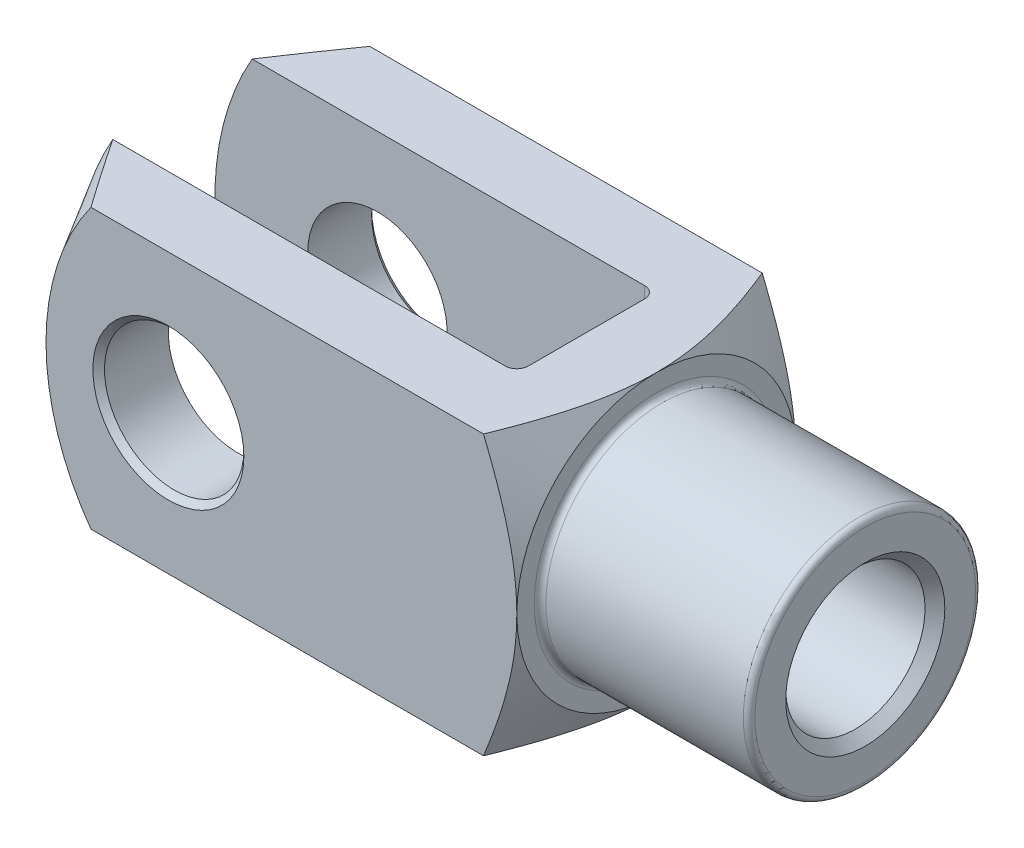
ISO-10303-21;
HEADER;
FILE_DESCRIPTION(('STEP AP214'),'2;1');
FILE_NAME('part.step','',(''),(''),'','','');
FILE_SCHEMA(('AUTOMOTIVE_DESIGN { 1 0 10303 214 1 1 1 1 }'));
ENDSEC;
DATA;
#1=APPLICATION_CONTEXT('core data for automotive mechanical design processes');
#2=APPLICATION_PROTOCOL_DEFINITION('international standard','automotive_design',2000,#1);
#3=PRODUCT_CONTEXT('',#1,'mechanical');
#4=PRODUCT('Part','Part','',(#3));
#5=PRODUCT_RELATED_PRODUCT_CATEGORY('part','',(#4));
#6=PRODUCT_DEFINITION_FORMATION('','',#4);
#7=PRODUCT_DEFINITION_CONTEXT('part definition',#1,'design');
#8=PRODUCT_DEFINITION('design','',#6,#7);
#9=PRODUCT_DEFINITION_SHAPE('','',#8);
#10=(LENGTH_UNIT() NAMED_UNIT(*) SI_UNIT(.MILLI.,.METRE.));
#11=(NAMED_UNIT(*) PLANE_ANGLE_UNIT() SI_UNIT($,.RADIAN.));
#12=(NAMED_UNIT(*) SI_UNIT($,.STERADIAN.) SOLID_ANGLE_UNIT());
#13=UNCERTAINTY_MEASURE_WITH_UNIT(LENGTH_MEASURE(1.E-05),#10,'distance_accuracy_value','');
#14=(GEOMETRIC_REPRESENTATION_CONTEXT(3) GLOBAL_UNCERTAINTY_ASSIGNED_CONTEXT((#13)) GLOBAL_UNIT_ASSIGNED_CONTEXT((#10,
#11,#12)) REPRESENTATION_CONTEXT('',''));
#15=CARTESIAN_POINT('',(0.,0.,0.));
#16=DIRECTION('',(0.,0.,1.));
#17=DIRECTION('',(1.,0.,0.));
#18=AXIS2_PLACEMENT_3D('',#15,#16,#17);
#19=CARTESIAN_POINT('',(-25.,-12.,-4.99999999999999));
#20=DIRECTION('',(0.,-1.,0.));
#21=DIRECTION('',(0.,0.,-1.));
#22=AXIS2_PLACEMENT_3D('',#19,#20,#21);
#23=CYLINDRICAL_SURFACE('',#22,1.);
#24=DIRECTION('',(0.,1.,0.));
#25=VECTOR('',#24,1.);
#26=CARTESIAN_POINT('',(-24.,-12.,-4.99999999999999));
#27=LINE('',#26,#25);
#28=CARTESIAN_POINT('',(-24.,-3.31662479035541,-4.99999999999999));
#29=VERTEX_POINT('',#28);
#30=CARTESIAN_POINT('',(-24.,-12.,-4.99999999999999));
#31=VERTEX_POINT('',#30);
#32=EDGE_CURVE('E358',#29,#31,#27,.F.);
#33=ORIENTED_EDGE('',*,*,#32,.F.);
#34=CARTESIAN_POINT('',(-24.,-3.31662479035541,-4.99999999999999));
#35=CARTESIAN_POINT('',(-24.000039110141,-3.2458892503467,-5.04693073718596));
#36=CARTESIAN_POINT('',(-24.0032998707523,-3.17421071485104,-5.0923055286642));
#37=CARTESIAN_POINT('',(-24.0152871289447,-3.02944292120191,-5.17972843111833));
#38=CARTESIAN_POINT('',(-24.0240049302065,-2.95635608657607,-5.22178171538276));
#39=CARTESIAN_POINT('',(-24.0458771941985,-2.80940810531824,-5.30228419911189));
#40=CARTESIAN_POINT('',(-24.0590080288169,-2.73555307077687,-5.34075122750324));
#41=CARTESIAN_POINT('',(-24.0890023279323,-2.58689159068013,-5.41432119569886));
#42=CARTESIAN_POINT('',(-24.1058679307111,-2.51208462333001,-5.44942219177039));
#43=CARTESIAN_POINT('',(-24.1575747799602,-2.30106419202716,-5.54321172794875));
#44=CARTESIAN_POINT('',(-24.1959404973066,-2.16400188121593,-5.59808248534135));
#45=CARTESIAN_POINT('',(-24.2800168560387,-1.88823561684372,-5.69702137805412));
#46=CARTESIAN_POINT('',(-24.3257315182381,-1.74953080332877,-5.74108356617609));
#47=CARTESIAN_POINT('',(-24.422565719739,-1.47057265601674,-5.81880111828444));
#48=CARTESIAN_POINT('',(-24.4737025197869,-1.33031573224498,-5.85242182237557));
#49=CARTESIAN_POINT('',(-24.579554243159,-1.04914006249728,-5.90930382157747));
#50=CARTESIAN_POINT('',(-24.634267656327,-0.908221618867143,-5.9325694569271));
#51=CARTESIAN_POINT('',(-24.7396434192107,-0.641756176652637,-5.96691885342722));
#52=CARTESIAN_POINT('',(-24.7900743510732,-0.51625291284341,-5.97907412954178));
#53=CARTESIAN_POINT('',(-24.891718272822,-0.265271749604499,-5.99544962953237));
#54=CARTESIAN_POINT('',(-24.9429298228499,-0.139794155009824,-5.99968301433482));
#55=CARTESIAN_POINT('',(-24.9960964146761,-0.00956179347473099,-5.99999428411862));
#56=CARTESIAN_POINT('',(-24.9980482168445,-0.00478087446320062,-5.99999999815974));
#57=CARTESIAN_POINT('',(-25.,0.,-6.));
#58=B_SPLINE_CURVE_WITH_KNOTS('',3,(#34,#35,#36,#37,#38,#39,#40,#41,#42,#43,#44,#45,#46,#47,#48,
#49,#50,#51,#52,#53,#54,#55,#56,#57),.UNSPECIFIED.,.F.,.F.,(4,2,2,2,2,2,2,2,2,2,2,4),(0.,
0.254478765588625,0.508553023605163,0.76128804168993,1.01416813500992,1.47107229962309,
1.92822730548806,2.38688397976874,2.8453482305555,3.25253093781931,3.65903657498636,
3.67452851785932),.UNSPECIFIED.);
#59=CARTESIAN_POINT('',(-25.,0.,-6.));
#60=VERTEX_POINT('',#59);
#61=EDGE_CURVE('E390',#29,#60,#58,.T.);
#62=ORIENTED_EDGE('',*,*,#61,.T.);
#63=DIRECTION('',(0.,1.,0.));
#64=VECTOR('',#63,1.);
#65=CARTESIAN_POINT('',(-25.,12.,-5.99999999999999));
#66=LINE('',#65,#64);
#67=CARTESIAN_POINT('',(-25.,-12.,-5.99999999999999));
#68=VERTEX_POINT('',#67);
#69=EDGE_CURVE('E182',#68,#60,#66,.T.);
#70=ORIENTED_EDGE('',*,*,#69,.F.);
#71=CARTESIAN_POINT('',(-25.,-12.,-4.99999999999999));
#72=DIRECTION('',(0.,-1.,0.));
#73=DIRECTION('',(0.,0.,-1.));
#74=AXIS2_PLACEMENT_3D('',#71,#72,#73);
#75=CIRCLE('',#74,1.);
#76=EDGE_CURVE('E197',#31,#68,#75,.F.);
#77=ORIENTED_EDGE('',*,*,#76,.F.);
#78=EDGE_LOOP('',(#33,#62,#70,#77));
#79=FACE_BOUND('',#78,.T.);
#80=ADVANCED_FACE('F37',(#79),#23,.F.);
#81=CARTESIAN_POINT('',(-24.,-12.,-5.99999999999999));
#82=DIRECTION('',(1.,0.,0.));
#83=DIRECTION('',(0.,0.,-1.));
#84=AXIS2_PLACEMENT_3D('',#81,#82,#83);
#85=PLANE('',#84);
#86=CARTESIAN_POINT('',(-24.,12.,-4.99999999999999));
#87=VERTEX_POINT('',#86);
#88=CARTESIAN_POINT('',(-24.,3.31662479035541,-4.99999999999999));
#89=VERTEX_POINT('',#88);
#90=EDGE_CURVE('E374',#87,#89,#27,.F.);
#91=ORIENTED_EDGE('',*,*,#90,.T.);
#92=CARTESIAN_POINT('',(-24.,0.,0.));
#93=DIRECTION('',(1.,0.,0.));
#94=DIRECTION('',(0.,0.,-1.));
#95=AXIS2_PLACEMENT_3D('',#92,#93,#94);
#96=CIRCLE('',#95,6.);
#97=CARTESIAN_POINT('',(-24.,3.31662479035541,5.));
#98=VERTEX_POINT('',#97);
#99=EDGE_CURVE('E747',#89,#98,#96,.T.);
#100=ORIENTED_EDGE('',*,*,#99,.T.);
#101=DIRECTION('',(0.,1.,0.));
#102=VECTOR('',#101,1.);
#103=CARTESIAN_POINT('',(-24.,12.,5.));
#104=LINE('',#103,#102);
#105=CARTESIAN_POINT('',(-24.,12.,5.));
#106=VERTEX_POINT('',#105);
#107=EDGE_CURVE('E160',#98,#106,#104,.T.);
#108=ORIENTED_EDGE('',*,*,#107,.T.);
#109=DIRECTION('',(0.,0.,-1.));
#110=VECTOR('',#109,1.);
#111=CARTESIAN_POINT('',(-24.,12.,-5.99999999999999));
#112=LINE('',#111,#110);
#113=EDGE_CURVE('E338',#106,#87,#112,.T.);
#114=ORIENTED_EDGE('',*,*,#113,.T.);
#115=EDGE_LOOP('',(#91,#100,#108,#114));
#116=FACE_BOUND('',#115,.T.);
#117=ADVANCED_FACE('F462',(#116),#85,.F.);
#118=CARTESIAN_POINT('',(-25.,-12.,5.));
#119=DIRECTION('',(0.,-1.,0.));
#120=DIRECTION('',(0.,0.,-1.));
#121=AXIS2_PLACEMENT_3D('',#118,#119,#120);
#122=CYLINDRICAL_SURFACE('',#121,1.);
#123=ORIENTED_EDGE('',*,*,#107,.F.);
#124=CARTESIAN_POINT('',(-24.,3.31662479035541,5.));
#125=CARTESIAN_POINT('',(-24.000039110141,3.2458892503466,5.04693073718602));
#126=CARTESIAN_POINT('',(-24.0032998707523,3.17421071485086,5.09230552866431));
#127=CARTESIAN_POINT('',(-24.0152871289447,3.02944292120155,5.17972843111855));
#128=CARTESIAN_POINT('',(-24.0240049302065,2.95635608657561,5.22178171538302));
#129=CARTESIAN_POINT('',(-24.0458771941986,2.80940810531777,5.30228419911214));
#130=CARTESIAN_POINT('',(-24.0590080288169,2.73555307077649,5.34075122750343));
#131=CARTESIAN_POINT('',(-24.0890023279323,2.58689159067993,5.41432119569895));
#132=CARTESIAN_POINT('',(-24.1058679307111,2.51208462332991,5.44942219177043));
#133=CARTESIAN_POINT('',(-24.1575747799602,2.30106419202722,5.54321172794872));
#134=CARTESIAN_POINT('',(-24.1959404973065,2.16400188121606,5.5980824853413));
#135=CARTESIAN_POINT('',(-24.2800168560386,1.88823561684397,5.69702137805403));
#136=CARTESIAN_POINT('',(-24.3257315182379,1.74953080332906,5.74108356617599));
#137=CARTESIAN_POINT('',(-24.422565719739,1.47057265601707,5.81880111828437));
#138=CARTESIAN_POINT('',(-24.473702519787,1.33031573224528,5.85242182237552));
#139=CARTESIAN_POINT('',(-24.5795542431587,1.04914006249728,5.90930382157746));
#140=CARTESIAN_POINT('',(-24.6342676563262,0.908221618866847,5.93256945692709));
#141=CARTESIAN_POINT('',(-24.7396434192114,0.641756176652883,5.96691885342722));
#142=CARTESIAN_POINT('',(-24.7900743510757,0.516252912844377,5.97907412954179));
#143=CARTESIAN_POINT('',(-24.8917182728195,0.265271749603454,5.99544962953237));
#144=CARTESIAN_POINT('',(-24.9429298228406,0.13979415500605,5.9996830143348));
#145=CARTESIAN_POINT('',(-24.9960964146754,0.00956179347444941,5.99999428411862));
#146=CARTESIAN_POINT('',(-24.9980482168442,0.00478087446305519,5.99999999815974));
#147=CARTESIAN_POINT('',(-25.,0.,6.));
#148=B_SPLINE_CURVE_WITH_KNOTS('',3,(#124,#125,#126,#127,#128,#129,#130,#131,#132,#133,#134,
#135,#136,#137,#138,#139,#140,#141,#142,#143,#144,#145,#146,#147),.UNSPECIFIED.,.F.,.F.,(4,2,2,
2,2,2,2,2,2,2,2,4),(0.,0.254478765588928,0.508553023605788,0.76128804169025,1.01416813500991,
1.47107229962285,1.92822730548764,2.38688397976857,2.84534823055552,3.25253093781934,
3.65903657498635,3.67452851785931),.UNSPECIFIED.);
#149=CARTESIAN_POINT('',(-25.,0.,6.));
#150=VERTEX_POINT('',#149);
#151=EDGE_CURVE('E145',#98,#150,#148,.T.);
#152=ORIENTED_EDGE('',*,*,#151,.T.);
#153=DIRECTION('',(0.,1.,0.));
#154=VECTOR('',#153,1.);
#155=CARTESIAN_POINT('',(-25.,-12.,6.));
#156=LINE('',#155,#154);
#157=CARTESIAN_POINT('',(-25.,12.,6.));
#158=VERTEX_POINT('',#157);
#159=EDGE_CURVE('E159',#158,#150,#156,.F.);
#160=ORIENTED_EDGE('',*,*,#159,.F.);
#161=CARTESIAN_POINT('',(-25.,12.,5.));
#162=DIRECTION('',(0.,1.,0.));
#163=DIRECTION('',(0.,0.,1.));
#164=AXIS2_PLACEMENT_3D('',#161,#162,#163);
#165=CIRCLE('',#164,1.);
#166=EDGE_CURVE('E189',#106,#158,#165,.F.);
#167=ORIENTED_EDGE('',*,*,#166,.F.);
#168=EDGE_LOOP('',(#123,#152,#160,#167));
#169=FACE_BOUND('',#168,.T.);
#170=ADVANCED_FACE('F156',(#169),#122,.F.);
#171=CARTESIAN_POINT('',(-62.,-12.,-5.99999999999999));
#172=DIRECTION('',(0.,0.,-1.));
#173=DIRECTION('',(-1.,0.,0.));
#174=AXIS2_PLACEMENT_3D('',#171,#172,#173);
#175=PLANE('',#174);
#176=CARTESIAN_POINT('',(-48.,0.,-5.99999999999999));
#177=DIRECTION('',(0.,0.,-1.));
#178=DIRECTION('',(-1.,0.,0.));
#179=AXIS2_PLACEMENT_3D('',#176,#177,#178);
#180=CIRCLE('',#179,6.);
#181=CARTESIAN_POINT('',(-54.,0.,-5.99999999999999));
#182=VERTEX_POINT('',#181);
#183=EDGE_CURVE('E368',#182,#182,#180,.F.);
#184=ORIENTED_EDGE('',*,*,#183,.F.);
#185=EDGE_LOOP('',(#184));
#186=FACE_BOUND('',#185,.T.);
#187=CARTESIAN_POINT('',(-38.,0.,-5.99999999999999));
#188=DIRECTION('',(0.,0.,1.));
#189=DIRECTION('',(1.,0.,0.));
#190=AXIS2_PLACEMENT_3D('',#187,#188,#189);
#191=CIRCLE('',#190,24.);
#192=CARTESIAN_POINT('',(-58.7846096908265,12.,-5.99999999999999));
#193=VERTEX_POINT('',#192);
#194=CARTESIAN_POINT('',(-58.7846096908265,-12.,-5.99999999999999));
#195=VERTEX_POINT('',#194);
#196=EDGE_CURVE('E276',#193,#195,#191,.T.);
#197=ORIENTED_EDGE('',*,*,#196,.T.);
#198=DIRECTION('',(-1.,0.,0.));
#199=VECTOR('',#198,1.);
#200=CARTESIAN_POINT('',(-62.,-12.,-5.99999999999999));
#201=LINE('',#200,#199);
#202=EDGE_CURVE('E333',#68,#195,#201,.T.);
#203=ORIENTED_EDGE('',*,*,#202,.F.);
#204=ORIENTED_EDGE('',*,*,#69,.T.);
#205=CARTESIAN_POINT('',(-25.,12.,-5.99999999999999));
#206=VERTEX_POINT('',#205);
#207=EDGE_CURVE('E179',#60,#206,#66,.T.);
#208=ORIENTED_EDGE('',*,*,#207,.T.);
#209=DIRECTION('',(-1.,0.,0.));
#210=VECTOR('',#209,1.);
#211=CARTESIAN_POINT('',(-62.,12.,-5.99999999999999));
#212=LINE('',#211,#210);
#213=EDGE_CURVE('E346',#206,#193,#212,.T.);
#214=ORIENTED_EDGE('',*,*,#213,.T.);
#215=EDGE_LOOP('',(#197,#203,#204,#208,#214));
#216=FACE_BOUND('',#215,.T.);
#217=ADVANCED_FACE('F393',(#186,#216),#175,.F.);
#218=CARTESIAN_POINT('',(-62.,-12.,6.00000000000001));
#219=DIRECTION('',(0.,0.,1.));
#220=DIRECTION('',(1.,0.,0.));
#221=AXIS2_PLACEMENT_3D('',#218,#219,#220);
#222=PLANE('',#221);
#223=CARTESIAN_POINT('',(-48.,0.,6.));
#224=DIRECTION('',(0.,0.,1.));
#225=DIRECTION('',(1.,0.,0.));
#226=AXIS2_PLACEMENT_3D('',#223,#224,#225);
#227=CIRCLE('',#226,6.);
#228=CARTESIAN_POINT('',(-42.,0.,6.));
#229=VERTEX_POINT('',#228);
#230=EDGE_CURVE('E345',#229,#229,#227,.F.);
#231=ORIENTED_EDGE('',*,*,#230,.F.);
#232=EDGE_LOOP('',(#231));
#233=FACE_BOUND('',#232,.T.);
#234=DIRECTION('',(1.,0.,0.));
#235=VECTOR('',#234,1.);
#236=CARTESIAN_POINT('',(-62.,-12.,6.00000000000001));
#237=LINE('',#236,#235);
#238=CARTESIAN_POINT('',(-58.7846096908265,-12.,6.00000000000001));
#239=VERTEX_POINT('',#238);
#240=CARTESIAN_POINT('',(-25.,-12.,6.));
#241=VERTEX_POINT('',#240);
#242=EDGE_CURVE('E337',#239,#241,#237,.T.);
#243=ORIENTED_EDGE('',*,*,#242,.F.);
#244=CARTESIAN_POINT('',(-38.,0.,6.00000000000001));
#245=DIRECTION('',(0.,0.,1.));
#246=DIRECTION('',(1.,0.,0.));
#247=AXIS2_PLACEMENT_3D('',#244,#245,#246);
#248=CIRCLE('',#247,24.);
#249=CARTESIAN_POINT('',(-58.7846096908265,12.,6.00000000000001));
#250=VERTEX_POINT('',#249);
#251=EDGE_CURVE('E414',#250,#239,#248,.T.);
#252=ORIENTED_EDGE('',*,*,#251,.F.);
#253=DIRECTION('',(1.,0.,0.));
#254=VECTOR('',#253,1.);
#255=CARTESIAN_POINT('',(-62.,12.,6.00000000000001));
#256=LINE('',#255,#254);
#257=EDGE_CURVE('E176',#250,#158,#256,.T.);
#258=ORIENTED_EDGE('',*,*,#257,.T.);
#259=ORIENTED_EDGE('',*,*,#159,.T.);
#260=EDGE_CURVE('E164',#150,#241,#156,.F.);
#261=ORIENTED_EDGE('',*,*,#260,.T.);
#262=EDGE_LOOP('',(#243,#252,#258,#259,#261));
#263=FACE_BOUND('',#262,.T.);
#264=ADVANCED_FACE('F173',(#233,#263),#222,.F.);
#265=CARTESIAN_POINT('',(-62.,-12.,12.));
#266=DIRECTION('',(0.,0.,1.));
#267=DIRECTION('',(1.,0.,0.));
#268=AXIS2_PLACEMENT_3D('',#265,#266,#267);
#269=PLANE('',#268);
#270=CARTESIAN_POINT('',(-48.,0.,12.));
#271=DIRECTION('',(0.,0.,1.));
#272=DIRECTION('',(1.,0.,0.));
#273=AXIS2_PLACEMENT_3D('',#270,#271,#272);
#274=CIRCLE('',#273,6.50000000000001);
#275=CARTESIAN_POINT('',(-41.5,0.,12.));
#276=VERTEX_POINT('',#275);
#277=EDGE_CURVE('E228',#276,#276,#274,.F.);
#278=ORIENTED_EDGE('',*,*,#277,.T.);
#279=EDGE_LOOP('',(#278));
#280=FACE_BOUND('',#279,.T.);
#281=DIRECTION('',(1.,0.,0.));
#282=VECTOR('',#281,1.);
#283=CARTESIAN_POINT('',(-62.,12.,12.));
#284=LINE('',#283,#282);
#285=CARTESIAN_POINT('',(-54.6650269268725,12.,12.));
#286=VERTEX_POINT('',#285);
#287=CARTESIAN_POINT('',(-20.8697557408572,12.,12.));
#288=VERTEX_POINT('',#287);
#289=EDGE_CURVE('E365',#286,#288,#284,.T.);
#290=ORIENTED_EDGE('',*,*,#289,.F.);
#291=CARTESIAN_POINT('',(-38.,0.,12.));
#292=DIRECTION('',(0.,0.,1.));
#293=DIRECTION('',(1.,0.,0.));
#294=AXIS2_PLACEMENT_3D('',#291,#292,#293);
#295=CIRCLE('',#294,20.5358983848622);
#296=CARTESIAN_POINT('',(-54.6650269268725,-12.,12.));
#297=VERTEX_POINT('',#296);
#298=EDGE_CURVE('E61',#286,#297,#295,.T.);
#299=ORIENTED_EDGE('',*,*,#298,.T.);
#300=DIRECTION('',(1.,0.,0.));
#301=VECTOR('',#300,1.);
#302=CARTESIAN_POINT('',(-62.,-12.,12.));
#303=LINE('',#302,#301);
#304=CARTESIAN_POINT('',(-20.8697557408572,-12.,12.));
#305=VERTEX_POINT('',#304);
#306=EDGE_CURVE('E362',#297,#305,#303,.T.);
#307=ORIENTED_EDGE('',*,*,#306,.T.);
#308=CARTESIAN_POINT('',(-26.8270481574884,-24.508852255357,12.));
#309=CARTESIAN_POINT('',(-26.5204158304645,-23.9174203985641,12.));
#310=CARTESIAN_POINT('',(-26.2154046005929,-23.3251403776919,12.));
#311=CARTESIAN_POINT('',(-25.6094839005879,-22.1384473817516,12.));
#312=CARTESIAN_POINT('',(-25.3085746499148,-21.5440342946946,12.));
#313=CARTESIAN_POINT('',(-24.7112306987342,-20.3516642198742,12.));
#314=CARTESIAN_POINT('',(-24.4148047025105,-19.753702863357,12.));
#315=CARTESIAN_POINT('',(-23.8281918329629,-18.5547362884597,12.));
#316=CARTESIAN_POINT('',(-23.5380048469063,-17.9537311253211,12.));
#317=CARTESIAN_POINT('',(-22.9478447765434,-16.7109015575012,12.));
#318=CARTESIAN_POINT('',(-22.6483679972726,-16.0688406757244,12.));
#319=CARTESIAN_POINT('',(-22.0608191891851,-14.7794664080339,12.));
#320=CARTESIAN_POINT('',(-21.7727477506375,-14.132152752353,12.));
#321=CARTESIAN_POINT('',(-21.211729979,-12.8312921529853,12.));
#322=CARTESIAN_POINT('',(-20.9387769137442,-12.177748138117,12.));
#323=CARTESIAN_POINT('',(-20.5444276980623,-11.1914316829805,12.));
#324=CARTESIAN_POINT('',(-20.4154954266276,-10.8616706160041,12.));
#325=CARTESIAN_POINT('',(-20.1634870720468,-10.1999223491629,12.));
#326=CARTESIAN_POINT('',(-20.0404108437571,-9.867935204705,12.));
#327=CARTESIAN_POINT('',(-19.7750973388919,-9.12924658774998,12.));
#328=CARTESIAN_POINT('',(-19.6344928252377,-8.72195527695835,12.));
#329=CARTESIAN_POINT('',(-19.3653837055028,-7.90341175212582,12.));
#330=CARTESIAN_POINT('',(-19.2368780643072,-7.4921598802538,12.));
#331=CARTESIAN_POINT('',(-18.99435151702,-6.66538582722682,12.));
#332=CARTESIAN_POINT('',(-18.8803303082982,-6.24986373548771,12.));
#333=CARTESIAN_POINT('',(-18.6694959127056,-5.41444148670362,12.));
#334=CARTESIAN_POINT('',(-18.5726825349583,-4.99454137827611,12.));
#335=CARTESIAN_POINT('',(-18.4012191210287,-4.16046851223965,12.));
#336=CARTESIAN_POINT('',(-18.3261021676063,-3.74639268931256,12.));
#337=CARTESIAN_POINT('',(-18.1977094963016,-2.91483992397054,12.));
#338=CARTESIAN_POINT('',(-18.1444330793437,-2.49736309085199,12.));
#339=CARTESIAN_POINT('',(-18.061948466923,-1.66028284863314,12.));
#340=CARTESIAN_POINT('',(-18.032724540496,-1.24068101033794,12.));
#341=CARTESIAN_POINT('',(-17.9996341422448,-0.400474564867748,12.));
#342=CARTESIAN_POINT('',(-17.9957667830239,0.0201300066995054,12.));
#343=CARTESIAN_POINT('',(-18.0129154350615,0.830148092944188,12.));
#344=CARTESIAN_POINT('',(-18.0321388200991,1.2196011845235,12.));
#345=CARTESIAN_POINT('',(-18.091746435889,1.99686728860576,12.));
#346=CARTESIAN_POINT('',(-18.1321306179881,2.38468030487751,12.));
#347=CARTESIAN_POINT('',(-18.232579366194,3.15792367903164,12.));
#348=CARTESIAN_POINT('',(-18.2926540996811,3.54335270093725,12.));
#349=CARTESIAN_POINT('',(-18.4305032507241,4.31101186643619,12.));
#350=CARTESIAN_POINT('',(-18.5082781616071,4.69324192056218,12.));
#351=CARTESIAN_POINT('',(-18.6818401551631,5.46519444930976,12.));
#352=CARTESIAN_POINT('',(-18.7780834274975,5.85481356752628,12.));
#353=CARTESIAN_POINT('',(-18.9846981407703,6.63026168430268,12.));
#354=CARTESIAN_POINT('',(-19.0950697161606,7.01609064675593,12.));
#355=CARTESIAN_POINT('',(-19.327805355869,7.78407900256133,12.));
#356=CARTESIAN_POINT('',(-19.450168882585,8.16623855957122,12.));
#357=CARTESIAN_POINT('',(-19.6413066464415,8.73690278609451,12.));
#358=CARTESIAN_POINT('',(-19.706283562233,8.92669203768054,12.));
#359=CARTESIAN_POINT('',(-19.8385670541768,9.30545658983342,12.));
#360=CARTESIAN_POINT('',(-19.9058736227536,9.49443189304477,12.));
#361=CARTESIAN_POINT('',(-20.1221378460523,10.09093133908,12.));
#362=CARTESIAN_POINT('',(-20.2750221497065,10.4970351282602,12.));
#363=CARTESIAN_POINT('',(-20.5890916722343,11.3060297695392,12.));
#364=CARTESIAN_POINT('',(-20.750277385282,11.7089204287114,12.));
#365=CARTESIAN_POINT('',(-21.0796092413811,12.5119467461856,12.));
#366=CARTESIAN_POINT('',(-21.2477569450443,12.9120817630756,12.));
#367=CARTESIAN_POINT('',(-21.5898549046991,13.7098486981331,12.));
#368=CARTESIAN_POINT('',(-21.7638050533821,14.1074806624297,12.));
#369=CARTESIAN_POINT('',(-22.1167497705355,14.900905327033,12.));
#370=CARTESIAN_POINT('',(-22.2957485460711,15.296696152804,12.));
#371=CARTESIAN_POINT('',(-22.6579079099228,16.0863711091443,12.));
#372=CARTESIAN_POINT('',(-22.841068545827,16.4802552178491,12.));
#373=CARTESIAN_POINT('',(-23.3958010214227,17.6593177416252,12.));
#374=CARTESIAN_POINT('',(-23.7726679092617,18.4420054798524,12.));
#375=CARTESIAN_POINT('',(-24.5379796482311,20.004634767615,12.));
#376=CARTESIAN_POINT('',(-24.9264562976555,20.7845606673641,12.));
#377=CARTESIAN_POINT('',(-25.7113669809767,22.3404133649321,12.));
#378=CARTESIAN_POINT('',(-26.107801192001,23.1163400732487,12.));
#379=CARTESIAN_POINT('',(-26.9066094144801,24.6646398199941,12.));
#380=CARTESIAN_POINT('',(-27.3089803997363,25.4370144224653,12.));
#381=CARTESIAN_POINT('',(-28.1185505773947,26.9792185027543,12.));
#382=CARTESIAN_POINT('',(-28.5257497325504,27.7490480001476,12.));
#383=CARTESIAN_POINT('',(-29.6315922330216,29.8271201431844,12.));
#384=CARTESIAN_POINT('',(-30.3338843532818,31.1334202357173,12.));
#385=CARTESIAN_POINT('',(-31.7463886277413,33.7419610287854,12.));
#386=CARTESIAN_POINT('',(-32.4566018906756,35.0442011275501,12.));
#387=CARTESIAN_POINT('',(-33.8786764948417,37.6380871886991,12.));
#388=CARTESIAN_POINT('',(-34.5905050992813,38.9297511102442,12.));
#389=CARTESIAN_POINT('',(-35.6613936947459,40.865371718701,12.));
#390=CARTESIAN_POINT('',(-36.0188525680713,41.5102153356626,12.));
#391=CARTESIAN_POINT('',(-36.7347123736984,42.7993785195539,12.));
#392=CARTESIAN_POINT('',(-37.0931133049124,43.4436980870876,12.));
#393=CARTESIAN_POINT('',(-37.4519232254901,44.0877898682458,12.));
#394=B_SPLINE_CURVE_WITH_KNOTS('',3,(#308,#309,#310,#311,#312,#313,#314,#315,#316,#317,#318,
#319,#320,#321,#322,#323,#324,#325,#326,#327,#328,#329,#330,#331,#332,#333,#334,#335,#336,#337,
#338,#339,#340,#341,#342,#343,#344,#345,#346,#347,#348,#349,#350,#351,#352,#353,#354,#355,#356,
#357,#358,#359,#360,#361,#362,#363,#364,#365,#366,#367,#368,#369,#370,#371,#372,#373,#374,#375,
#376,#377,#378,#379,#380,#381,#382,#383,#384,#385,#386,#387,#388,#389,#390,#391,#392,#393),
.UNSPECIFIED.,.F.,.F.,(4,2,2,2,2,2,2,2,2,2,2,2,2,2,2,2,2,2,2,2,2,2,2,2,2,2,2,2,2,2,2,2,2,2,2,2,
2,2,2,2,2,2,4),(0.,1.99859095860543,3.99728842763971,5.99946635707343,8.00160807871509,
10.1269271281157,12.2523560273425,14.3768307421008,15.4389968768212,16.501136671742,
17.793611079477,19.0859748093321,20.3783115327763,21.6706339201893,22.9326201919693,
24.194566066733,25.4556859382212,26.7167616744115,27.8859474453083,29.0551305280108,
30.2249182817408,31.3947386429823,32.5984184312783,33.8021096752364,35.0057469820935,
35.6075466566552,36.209344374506,37.51100701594,38.8127472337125,40.1147808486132,
41.4167903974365,42.719918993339,44.0230624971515,46.6290236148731,49.2429304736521,
51.8568955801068,54.469571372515,57.082227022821,61.5315331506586,65.9814700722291,
70.4059202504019,72.6177970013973,74.829671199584),.UNSPECIFIED.);
#395=CARTESIAN_POINT('',(-18.,0.,12.));
#396=VERTEX_POINT('',#395);
#397=EDGE_CURVE('E305',#396,#305,#394,.F.);
#398=ORIENTED_EDGE('',*,*,#397,.F.);
#399=EDGE_CURVE('E303',#288,#396,#394,.F.);
#400=ORIENTED_EDGE('',*,*,#399,.F.);
#401=EDGE_LOOP('',(#290,#299,#307,#398,#400));
#402=FACE_BOUND('',#401,.T.);
#403=ADVANCED_FACE('F287',(#280,#402),#269,.T.);
#404=CARTESIAN_POINT('',(-62.,-12.,12.));
#405=DIRECTION('',(0.,-1.,0.));
#406=DIRECTION('',(0.,0.,-1.));
#407=AXIS2_PLACEMENT_3D('',#404,#405,#406);
#408=PLANE('',#407);
#409=ORIENTED_EDGE('',*,*,#202,.T.);
#410=CARTESIAN_POINT('',(-68.2786029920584,-12.,8.84338025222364));
#411=CARTESIAN_POINT('',(-67.6947368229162,-12.,7.90330325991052));
#412=CARTESIAN_POINT('',(-67.1092717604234,-12.,6.96421474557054));
#413=CARTESIAN_POINT('',(-65.9343954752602,-12.,5.0884837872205));
#414=CARTESIAN_POINT('',(-65.3449841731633,-12.,4.15184139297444));
#415=CARTESIAN_POINT('',(-64.1607841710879,-12.,2.28039346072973));
#416=CARTESIAN_POINT('',(-63.565989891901,-12.,1.34559145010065));
#417=CARTESIAN_POINT('',(-62.3707199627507,-12.,-0.520365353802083));
#418=CARTESIAN_POINT('',(-61.7702443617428,-12.,-1.45152017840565));
#419=CARTESIAN_POINT('',(-60.5371594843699,-12.,-3.34796497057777));
#420=CARTESIAN_POINT('',(-59.9042532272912,-12.,-4.31306203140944));
#421=CARTESIAN_POINT('',(-58.6288928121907,-12.,-6.23692872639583));
#422=CARTESIAN_POINT('',(-57.9864387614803,-12.,-7.19569843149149));
#423=CARTESIAN_POINT('',(-57.0137395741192,-12.,-8.62721356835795));
#424=CARTESIAN_POINT('',(-56.6881242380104,-12.,-9.1031058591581));
#425=CARTESIAN_POINT('',(-56.0333476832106,-12.,-10.0524433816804));
#426=CARTESIAN_POINT('',(-55.7041864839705,-12.,-10.5258886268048));
#427=CARTESIAN_POINT('',(-55.0417887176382,-12.,-11.4698924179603));
#428=CARTESIAN_POINT('',(-54.7085523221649,-12.,-11.9404510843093));
#429=CARTESIAN_POINT('',(-54.0373266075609,-12.,-12.8781628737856));
#430=CARTESIAN_POINT('',(-53.6993373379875,-12.,-13.3453160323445));
#431=CARTESIAN_POINT('',(-53.0209560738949,-12.,-14.2712057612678));
#432=CARTESIAN_POINT('',(-52.6806158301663,-12.,-14.7299801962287));
#433=CARTESIAN_POINT('',(-51.9934550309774,-12.,-15.6426726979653));
#434=CARTESIAN_POINT('',(-51.6466343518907,-12.,-16.0965906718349));
#435=CARTESIAN_POINT('',(-50.944777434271,-12.,-16.999043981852));
#436=CARTESIAN_POINT('',(-50.5897305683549,-12.,-17.4475710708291));
#437=CARTESIAN_POINT('',(-49.8702804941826,-12.,-18.337043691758));
#438=CARTESIAN_POINT('',(-49.5058777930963,-12.,-18.7779896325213));
#439=CARTESIAN_POINT('',(-48.7694365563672,-12.,-19.645646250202));
#440=CARTESIAN_POINT('',(-48.3975164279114,-12.,-20.0724571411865));
#441=CARTESIAN_POINT('',(-47.639653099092,-12.,-20.9137472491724));
#442=CARTESIAN_POINT('',(-47.2537063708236,-12.,-21.3282233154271));
#443=CARTESIAN_POINT('',(-46.6621255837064,-12.,-21.9367708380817));
#444=CARTESIAN_POINT('',(-46.4630426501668,-12.,-22.1372171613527));
#445=CARTESIAN_POINT('',(-46.0599745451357,-12.,-22.533109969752));
#446=CARTESIAN_POINT('',(-45.8559896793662,-12.,-22.7285567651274));
#447=CARTESIAN_POINT('',(-45.4425971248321,-12.,-23.1134290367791));
#448=CARTESIAN_POINT('',(-45.2331922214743,-12.,-23.3028574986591));
#449=CARTESIAN_POINT('',(-44.8081788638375,-12.,-23.6745980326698));
#450=CARTESIAN_POINT('',(-44.5925713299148,-12.,-23.856911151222));
#451=CARTESIAN_POINT('',(-44.2600203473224,-12.,-24.1270885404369));
#452=CARTESIAN_POINT('',(-44.145633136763,-12.,-24.2181054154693));
#453=CARTESIAN_POINT('',(-43.9148670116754,-12.,-24.3975755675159));
#454=CARTESIAN_POINT('',(-43.7984881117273,-12.,-24.4860288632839));
#455=CARTESIAN_POINT('',(-43.4461413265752,-12.,-24.7471697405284));
#456=CARTESIAN_POINT('',(-43.2069947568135,-12.,-24.9156125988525));
#457=CARTESIAN_POINT('',(-42.7195001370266,-12.,-25.2383188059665));
#458=CARTESIAN_POINT('',(-42.4711595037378,-12.,-25.3925932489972));
#459=CARTESIAN_POINT('',(-41.9645146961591,-12.,-25.6835963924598));
#460=CARTESIAN_POINT('',(-41.7062131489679,-12.,-25.8203296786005));
#461=CARTESIAN_POINT('',(-41.0356348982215,-12.,-26.1405466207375));
#462=CARTESIAN_POINT('',(-40.6158504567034,-12.,-26.3091476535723));
#463=CARTESIAN_POINT('',(-39.9703142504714,-12.,-26.5095003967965));
#464=CARTESIAN_POINT('',(-39.7525810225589,-12.,-26.5675140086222));
#465=CARTESIAN_POINT('',(-39.3127569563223,-12.,-26.6640173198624));
#466=CARTESIAN_POINT('',(-39.0906663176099,-12.,-26.7025079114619));
#467=CARTESIAN_POINT('',(-38.6415790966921,-12.,-26.7585747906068));
#468=CARTESIAN_POINT('',(-38.4145556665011,-12.,-26.7759381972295));
#469=CARTESIAN_POINT('',(-37.9599023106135,-12.,-26.7882217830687));
#470=CARTESIAN_POINT('',(-37.7322724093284,-12.,-26.7831428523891));
#471=CARTESIAN_POINT('',(-37.2785688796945,-12.,-26.7507852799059));
#472=CARTESIAN_POINT('',(-37.0524955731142,-12.,-26.7235021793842));
#473=CARTESIAN_POINT('',(-36.6038899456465,-12.,-26.6479928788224));
#474=CARTESIAN_POINT('',(-36.3813581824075,-12.,-26.5997634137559));
#475=CARTESIAN_POINT('',(-35.9005519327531,-12.,-26.4736338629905));
#476=CARTESIAN_POINT('',(-35.64328906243,-12.,-26.3918933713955));
#477=CARTESIAN_POINT('',(-35.137130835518,-12.,-26.2055998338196));
#478=CARTESIAN_POINT('',(-34.8882402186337,-12.,-26.1010341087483));
#479=CARTESIAN_POINT('',(-34.3986617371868,-12.,-25.8726383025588));
#480=CARTESIAN_POINT('',(-34.1579999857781,-12.,-25.7487527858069));
#481=CARTESIAN_POINT('',(-33.6854799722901,-12.,-25.485398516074));
#482=CARTESIAN_POINT('',(-33.4536207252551,-12.,-25.3459315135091));
#483=CARTESIAN_POINT('',(-32.9233788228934,-12.,-25.0064399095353));
#484=CARTESIAN_POINT('',(-32.6281184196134,-12.,-24.8015559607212));
#485=CARTESIAN_POINT('',(-32.0502738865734,-12.,-24.3745460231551));
#486=CARTESIAN_POINT('',(-31.7676958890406,-12.,-24.1524118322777));
#487=CARTESIAN_POINT('',(-31.2130794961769,-12.,-23.6943719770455));
#488=CARTESIAN_POINT('',(-30.9410624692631,-12.,-23.4584405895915));
#489=CARTESIAN_POINT('',(-30.4066261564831,-12.,-22.9760898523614));
#490=CARTESIAN_POINT('',(-30.1442052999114,-12.,-22.7296722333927));
#491=CARTESIAN_POINT('',(-29.625830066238,-12.,-22.2267453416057));
#492=CARTESIAN_POINT('',(-29.3699307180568,-12.,-21.9701795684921));
#493=CARTESIAN_POINT('',(-28.8652654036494,-12.,-21.450131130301));
#494=CARTESIAN_POINT('',(-28.6164996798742,-12.,-21.1866482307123));
#495=CARTESIAN_POINT('',(-28.1253910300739,-12.,-20.6542828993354));
#496=CARTESIAN_POINT('',(-27.8830417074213,-12.,-20.3854063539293));
#497=CARTESIAN_POINT('',(-27.4036952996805,-12.,-19.842944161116));
#498=CARTESIAN_POINT('',(-27.1666981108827,-12.,-19.5693586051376));
#499=CARTESIAN_POINT('',(-26.6001496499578,-12.,-18.9040671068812));
#500=CARTESIAN_POINT('',(-26.2729278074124,-12.,-18.5103784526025));
#501=CARTESIAN_POINT('',(-25.6261860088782,-12.,-17.716617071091));
#502=CARTESIAN_POINT('',(-25.306667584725,-12.,-17.3165430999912));
#503=CARTESIAN_POINT('',(-24.6790054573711,-12.,-16.5174455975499));
#504=CARTESIAN_POINT('',(-24.3707624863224,-12.,-16.118499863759));
#505=CARTESIAN_POINT('',(-23.7597996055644,-12.,-15.316589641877));
#506=CARTESIAN_POINT('',(-23.457078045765,-12.,-14.9136264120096));
#507=CARTESIAN_POINT('',(-23.1566197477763,-12.,-14.5090044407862));
#508=B_SPLINE_CURVE_WITH_KNOTS('',3,(#410,#411,#412,#413,#414,#415,#416,#417,#418,#419,#420,
#421,#422,#423,#424,#425,#426,#427,#428,#429,#430,#431,#432,#433,#434,#435,#436,#437,#438,#439,
#440,#441,#442,#443,#444,#445,#446,#447,#448,#449,#450,#451,#452,#453,#454,#455,#456,#457,#458,
#459,#460,#461,#462,#463,#464,#465,#466,#467,#468,#469,#470,#471,#472,#473,#474,#475,#476,#477,
#478,#479,#480,#481,#482,#483,#484,#485,#486,#487,#488,#489,#490,#491,#492,#493,#494,#495,#496,
#497,#498,#499,#500,#501,#502,#503,#504,#505,#506,#507),.UNSPECIFIED.,.F.,.F.,(4,2,2,2,2,2,2,2,
2,2,2,2,2,2,2,2,2,2,2,2,2,2,2,2,2,2,2,2,2,2,2,2,2,2,2,2,2,2,2,2,2,2,2,2,2,2,2,2,4),(0.,
3.31991386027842,6.6398947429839,9.96383874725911,13.287754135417,16.7500600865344,
20.2123271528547,21.9421957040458,23.6720547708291,25.4018412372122,27.1316096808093,
28.8452569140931,30.5589368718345,32.2749700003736,33.9909103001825,35.6890521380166,
37.3876240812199,38.2350900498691,39.082503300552,39.9294893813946,40.7763504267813,
41.2148575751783,41.6533615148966,42.5304910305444,43.4069277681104,44.2831349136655,
45.6347123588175,46.3099700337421,46.9851968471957,47.6671724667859,48.3491210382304,
49.0312065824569,49.7133984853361,50.5219110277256,51.3308738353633,52.1422020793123,
52.9534392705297,54.0307393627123,55.1085548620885,56.188448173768,57.2681639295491,
58.3551054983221,59.4420839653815,60.5279345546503,61.6137640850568,63.1494038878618,
64.6853465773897,66.1977597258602,67.7097132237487),.UNSPECIFIED.);
#509=CARTESIAN_POINT('',(-54.6650269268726,-12.,-12.));
#510=VERTEX_POINT('',#509);
#511=EDGE_CURVE('E275',#195,#510,#508,.T.);
#512=ORIENTED_EDGE('',*,*,#511,.T.);
#513=DIRECTION('',(1.,0.,0.));
#514=VECTOR('',#513,1.);
#515=CARTESIAN_POINT('',(-62.,-12.,-12.));
#516=LINE('',#515,#514);
#517=CARTESIAN_POINT('',(-20.8697557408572,-12.,-12.));
#518=VERTEX_POINT('',#517);
#519=EDGE_CURVE('E359',#510,#518,#516,.T.);
#520=ORIENTED_EDGE('',*,*,#519,.T.);
#521=CARTESIAN_POINT('',(-26.8270481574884,-12.,-24.508852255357));
#522=CARTESIAN_POINT('',(-26.5204158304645,-12.,-23.9174203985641));
#523=CARTESIAN_POINT('',(-26.2154046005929,-12.,-23.3251403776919));
#524=CARTESIAN_POINT('',(-25.6094839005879,-12.,-22.1384473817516));
#525=CARTESIAN_POINT('',(-25.3085746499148,-12.,-21.5440342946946));
#526=CARTESIAN_POINT('',(-24.7112306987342,-12.,-20.3516642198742));
#527=CARTESIAN_POINT('',(-24.4148047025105,-12.,-19.753702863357));
#528=CARTESIAN_POINT('',(-23.8281918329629,-12.,-18.5547362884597));
#529=CARTESIAN_POINT('',(-23.5380048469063,-12.,-17.9537311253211));
#530=CARTESIAN_POINT('',(-22.9478447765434,-12.,-16.7109015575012));
#531=CARTESIAN_POINT('',(-22.6483679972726,-12.,-16.0688406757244));
#532=CARTESIAN_POINT('',(-22.0608191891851,-12.,-14.7794664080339));
#533=CARTESIAN_POINT('',(-21.7727477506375,-12.,-14.132152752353));
#534=CARTESIAN_POINT('',(-21.211729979,-12.,-12.8312921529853));
#535=CARTESIAN_POINT('',(-20.9387769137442,-12.,-12.177748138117));
#536=CARTESIAN_POINT('',(-20.5444276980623,-12.,-11.1914316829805));
#537=CARTESIAN_POINT('',(-20.4154954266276,-12.,-10.8616706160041));
#538=CARTESIAN_POINT('',(-20.1634870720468,-12.,-10.1999223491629));
#539=CARTESIAN_POINT('',(-20.0404108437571,-12.,-9.867935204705));
#540=CARTESIAN_POINT('',(-19.7750973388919,-12.,-9.12924658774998));
#541=CARTESIAN_POINT('',(-19.6344928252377,-12.,-8.72195527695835));
#542=CARTESIAN_POINT('',(-19.3653837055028,-12.,-7.90341175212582));
#543=CARTESIAN_POINT('',(-19.2368780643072,-12.,-7.4921598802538));
#544=CARTESIAN_POINT('',(-18.99435151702,-12.,-6.66538582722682));
#545=CARTESIAN_POINT('',(-18.8803303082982,-12.,-6.24986373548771));
#546=CARTESIAN_POINT('',(-18.6694959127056,-12.,-5.41444148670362));
#547=CARTESIAN_POINT('',(-18.5726825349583,-12.,-4.99454137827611));
#548=CARTESIAN_POINT('',(-18.4012191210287,-12.,-4.16046851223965));
#549=CARTESIAN_POINT('',(-18.3261021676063,-12.,-3.74639268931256));
#550=CARTESIAN_POINT('',(-18.1977094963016,-12.,-2.91483992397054));
#551=CARTESIAN_POINT('',(-18.1444330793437,-12.,-2.49736309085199));
#552=CARTESIAN_POINT('',(-18.061948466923,-12.,-1.66028284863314));
#553=CARTESIAN_POINT('',(-18.032724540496,-12.,-1.24068101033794));
#554=CARTESIAN_POINT('',(-17.9996341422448,-12.,-0.400474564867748));
#555=CARTESIAN_POINT('',(-17.9957667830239,-12.,0.0201300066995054));
#556=CARTESIAN_POINT('',(-18.0129154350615,-12.,0.830148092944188));
#557=CARTESIAN_POINT('',(-18.0321388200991,-12.,1.2196011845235));
#558=CARTESIAN_POINT('',(-18.091746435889,-12.,1.99686728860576));
#559=CARTESIAN_POINT('',(-18.1321306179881,-12.,2.38468030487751));
#560=CARTESIAN_POINT('',(-18.232579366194,-12.,3.15792367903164));
#561=CARTESIAN_POINT('',(-18.2926540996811,-12.,3.54335270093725));
#562=CARTESIAN_POINT('',(-18.4305032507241,-12.,4.31101186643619));
#563=CARTESIAN_POINT('',(-18.5082781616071,-12.,4.69324192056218));
#564=CARTESIAN_POINT('',(-18.6818401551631,-12.,5.46519444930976));
#565=CARTESIAN_POINT('',(-18.7780834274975,-12.,5.85481356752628));
#566=CARTESIAN_POINT('',(-18.9846981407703,-12.,6.63026168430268));
#567=CARTESIAN_POINT('',(-19.0950697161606,-12.,7.01609064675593));
#568=CARTESIAN_POINT('',(-19.327805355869,-12.,7.78407900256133));
#569=CARTESIAN_POINT('',(-19.450168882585,-12.,8.16623855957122));
#570=CARTESIAN_POINT('',(-19.6413066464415,-12.,8.73690278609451));
#571=CARTESIAN_POINT('',(-19.706283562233,-12.,8.92669203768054));
#572=CARTESIAN_POINT('',(-19.8385670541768,-12.,9.30545658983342));
#573=CARTESIAN_POINT('',(-19.9058736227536,-12.,9.49443189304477));
#574=CARTESIAN_POINT('',(-20.1221378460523,-12.,10.09093133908));
#575=CARTESIAN_POINT('',(-20.2750221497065,-12.,10.4970351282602));
#576=CARTESIAN_POINT('',(-20.5890916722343,-12.,11.3060297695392));
#577=CARTESIAN_POINT('',(-20.750277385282,-12.,11.7089204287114));
#578=CARTESIAN_POINT('',(-21.0796092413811,-12.,12.5119467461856));
#579=CARTESIAN_POINT('',(-21.2477569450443,-12.,12.9120817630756));
#580=CARTESIAN_POINT('',(-21.5898549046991,-12.,13.7098486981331));
#581=CARTESIAN_POINT('',(-21.7638050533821,-12.,14.1074806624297));
#582=CARTESIAN_POINT('',(-22.1167497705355,-12.,14.900905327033));
#583=CARTESIAN_POINT('',(-22.2957485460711,-12.,15.296696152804));
#584=CARTESIAN_POINT('',(-22.6579079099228,-12.,16.0863711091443));
#585=CARTESIAN_POINT('',(-22.841068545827,-12.,16.4802552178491));
#586=CARTESIAN_POINT('',(-23.3958010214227,-12.,17.6593177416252));
#587=CARTESIAN_POINT('',(-23.7726679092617,-12.,18.4420054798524));
#588=CARTESIAN_POINT('',(-24.5379796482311,-12.,20.004634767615));
#589=CARTESIAN_POINT('',(-24.9264562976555,-12.,20.7845606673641));
#590=CARTESIAN_POINT('',(-25.7113669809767,-12.,22.3404133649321));
#591=CARTESIAN_POINT('',(-26.107801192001,-12.,23.1163400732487));
#592=CARTESIAN_POINT('',(-26.9066094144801,-12.,24.6646398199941));
#593=CARTESIAN_POINT('',(-27.3089803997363,-12.,25.4370144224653));
#594=CARTESIAN_POINT('',(-28.1185505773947,-12.,26.9792185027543));
#595=CARTESIAN_POINT('',(-28.5257497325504,-12.,27.7490480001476));
#596=CARTESIAN_POINT('',(-29.6315922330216,-12.,29.8271201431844));
#597=CARTESIAN_POINT('',(-30.3338843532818,-12.,31.1334202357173));
#598=CARTESIAN_POINT('',(-31.7463886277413,-12.,33.7419610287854));
#599=CARTESIAN_POINT('',(-32.4566018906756,-12.,35.0442011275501));
#600=CARTESIAN_POINT('',(-33.8786764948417,-12.,37.6380871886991));
#601=CARTESIAN_POINT('',(-34.5905050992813,-12.,38.9297511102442));
#602=CARTESIAN_POINT('',(-35.6613936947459,-12.,40.865371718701));
#603=CARTESIAN_POINT('',(-36.0188525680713,-12.,41.5102153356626));
#604=CARTESIAN_POINT('',(-36.7347123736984,-12.,42.7993785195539));
#605=CARTESIAN_POINT('',(-37.0931133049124,-12.,43.4436980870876));
#606=CARTESIAN_POINT('',(-37.4519232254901,-12.,44.0877898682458));
#607=B_SPLINE_CURVE_WITH_KNOTS('',3,(#521,#522,#523,#524,#525,#526,#527,#528,#529,#530,#531,
#532,#533,#534,#535,#536,#537,#538,#539,#540,#541,#542,#543,#544,#545,#546,#547,#548,#549,#550,
#551,#552,#553,#554,#555,#556,#557,#558,#559,#560,#561,#562,#563,#564,#565,#566,#567,#568,#569,
#570,#571,#572,#573,#574,#575,#576,#577,#578,#579,#580,#581,#582,#583,#584,#585,#586,#587,#588,
#589,#590,#591,#592,#593,#594,#595,#596,#597,#598,#599,#600,#601,#602,#603,#604,#605,#606),
.UNSPECIFIED.,.F.,.F.,(4,2,2,2,2,2,2,2,2,2,2,2,2,2,2,2,2,2,2,2,2,2,2,2,2,2,2,2,2,2,2,2,2,2,2,2,
2,2,2,2,2,2,4),(0.,1.99859095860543,3.99728842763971,5.99946635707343,8.00160807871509,
10.1269271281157,12.2523560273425,14.3768307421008,15.4389968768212,16.501136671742,
17.793611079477,19.0859748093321,20.3783115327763,21.6706339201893,22.9326201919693,
24.194566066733,25.4556859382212,26.7167616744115,27.8859474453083,29.0551305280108,
30.2249182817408,31.3947386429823,32.5984184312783,33.8021096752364,35.0057469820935,
35.6075466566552,36.209344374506,37.51100701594,38.8127472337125,40.1147808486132,
41.4167903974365,42.719918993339,44.0230624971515,46.6290236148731,49.2429304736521,
51.8568955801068,54.469571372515,57.082227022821,61.5315331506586,65.9814700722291,
70.4059202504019,72.6177970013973,74.829671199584),.UNSPECIFIED.);
#608=CARTESIAN_POINT('',(-18.,-12.,0.));
#609=VERTEX_POINT('',#608);
#610=EDGE_CURVE('E304',#609,#518,#607,.F.);
#611=ORIENTED_EDGE('',*,*,#610,.F.);
#612=EDGE_CURVE('E295',#305,#609,#607,.F.);
#613=ORIENTED_EDGE('',*,*,#612,.F.);
#614=ORIENTED_EDGE('',*,*,#306,.F.);
#615=CARTESIAN_POINT('',(-23.1566197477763,-12.,14.5090044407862));
#616=CARTESIAN_POINT('',(-23.4006935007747,-12.,14.837725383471));
#617=CARTESIAN_POINT('',(-23.646275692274,-12.,15.165334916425));
#618=CARTESIAN_POINT('',(-24.1409326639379,-12.,15.8179416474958));
#619=CARTESIAN_POINT('',(-24.3900076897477,-12.,16.142938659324));
#620=CARTESIAN_POINT('',(-24.8925369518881,-12.,16.7904580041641));
#621=CARTESIAN_POINT('',(-25.1459981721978,-12.,17.1129749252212));
#622=CARTESIAN_POINT('',(-25.6574352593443,-12.,17.7544019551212));
#623=CARTESIAN_POINT('',(-25.9154110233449,-12.,18.0733121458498));
#624=CARTESIAN_POINT('',(-26.439130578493,-12.,18.7099803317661));
#625=CARTESIAN_POINT('',(-26.70492584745,-12.,19.0276960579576));
#626=CARTESIAN_POINT('',(-27.2426663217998,-12.,19.6578767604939));
#627=CARTESIAN_POINT('',(-27.5146113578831,-12.,19.9703418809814));
#628=CARTESIAN_POINT('',(-28.0655161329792,-12.,20.5886723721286));
#629=CARTESIAN_POINT('',(-28.3444711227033,-12.,20.8945419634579));
#630=CARTESIAN_POINT('',(-28.9108142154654,-12.,21.4983473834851));
#631=CARTESIAN_POINT('',(-29.1982014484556,-12.,21.7962840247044));
#632=CARTESIAN_POINT('',(-29.7368573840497,-12.,22.3359554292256));
#633=CARTESIAN_POINT('',(-29.9866698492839,-12.,22.5791402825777));
#634=CARTESIAN_POINT('',(-30.4945610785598,-12.,23.0568078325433));
#635=CARTESIAN_POINT('',(-30.7526406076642,-12.,23.2912897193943));
#636=CARTESIAN_POINT('',(-31.2785039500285,-12.,23.7494696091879));
#637=CARTESIAN_POINT('',(-31.5462931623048,-12.,23.9731614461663));
#638=CARTESIAN_POINT('',(-32.092915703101,-12.,24.4066687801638));
#639=CARTESIAN_POINT('',(-32.371747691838,-12.,24.6164859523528));
#640=CARTESIAN_POINT('',(-32.9019016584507,-12.,24.9899890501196));
#641=CARTESIAN_POINT('',(-33.1515693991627,-12.,25.1560107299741));
#642=CARTESIAN_POINT('',(-33.6612415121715,-12.,25.4716054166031));
#643=CARTESIAN_POINT('',(-33.9212474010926,-12.,25.6211759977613));
#644=CARTESIAN_POINT('',(-34.4513266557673,-12.,25.8992289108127));
#645=CARTESIAN_POINT('',(-34.7213645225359,-12.,26.0277782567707));
#646=CARTESIAN_POINT('',(-35.2721724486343,-12.,26.2593735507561));
#647=CARTESIAN_POINT('',(-35.5529357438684,-12.,26.36243527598));
#648=CARTESIAN_POINT('',(-36.0339246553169,-12.,26.5101311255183));
#649=CARTESIAN_POINT('',(-36.2316480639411,-12.,26.5629427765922));
#650=CARTESIAN_POINT('',(-36.63071076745,-12.,26.6525383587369));
#651=CARTESIAN_POINT('',(-36.832049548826,-12.,26.6893245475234));
#652=CARTESIAN_POINT('',(-37.23702442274,-12.,26.7455720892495));
#653=CARTESIAN_POINT('',(-37.4406589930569,-12.,26.7650443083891));
#654=CARTESIAN_POINT('',(-37.8488647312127,-12.,26.785964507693));
#655=CARTESIAN_POINT('',(-38.0534359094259,-12.,26.7874122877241));
#656=CARTESIAN_POINT('',(-38.461994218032,-12.,26.7722217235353));
#657=CARTESIAN_POINT('',(-38.6659810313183,-12.,26.7555749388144));
#658=CARTESIAN_POINT('',(-39.0717491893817,-12.,26.7048226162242));
#659=CARTESIAN_POINT('',(-39.2735305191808,-12.,26.6707169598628));
#660=CARTESIAN_POINT('',(-39.6737302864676,-12.,26.586233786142));
#661=CARTESIAN_POINT('',(-39.872147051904,-12.,26.5358484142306));
#662=CARTESIAN_POINT('',(-40.2646355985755,-12.,26.4203795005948));
#663=CARTESIAN_POINT('',(-40.4587067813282,-12.,26.3552939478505));
#664=CARTESIAN_POINT('',(-40.9503508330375,-12.,26.1716421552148));
#665=CARTESIAN_POINT('',(-41.244411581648,-12.,26.0436428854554));
#666=CARTESIAN_POINT('',(-41.8200460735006,-12.,25.7621328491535));
#667=CARTESIAN_POINT('',(-42.1016111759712,-12.,25.6086047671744));
#668=CARTESIAN_POINT('',(-42.6538882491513,-12.,25.280807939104));
#669=CARTESIAN_POINT('',(-42.9245503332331,-12.,25.1064557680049));
#670=CARTESIAN_POINT('',(-43.322192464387,-12.,24.8330606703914));
#671=CARTESIAN_POINT('',(-43.4533297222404,-12.,24.7399654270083));
#672=CARTESIAN_POINT('',(-43.7130123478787,-12.,24.550228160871));
#673=CARTESIAN_POINT('',(-43.8415577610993,-12.,24.4535862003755));
#674=CARTESIAN_POINT('',(-44.2265403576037,-12.,24.1566253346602));
#675=CARTESIAN_POINT('',(-44.4792216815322,-12.,23.9514271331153));
#676=CARTESIAN_POINT('',(-44.9758993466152,-12.,23.5307334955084));
#677=CARTESIAN_POINT('',(-45.2198935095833,-12.,23.3152355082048));
#678=CARTESIAN_POINT('',(-45.7004970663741,-12.,22.8757399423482));
#679=CARTESIAN_POINT('',(-45.9370993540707,-12.,22.6517346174));
#680=CARTESIAN_POINT('',(-46.4036408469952,-12.,22.1969500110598));
#681=CARTESIAN_POINT('',(-46.6335805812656,-12.,21.9661712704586));
#682=CARTESIAN_POINT('',(-47.0884661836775,-12.,21.4981654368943));
#683=CARTESIAN_POINT('',(-47.3133914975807,-12.,21.260918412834));
#684=CARTESIAN_POINT('',(-47.7581310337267,-12.,20.7816738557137));
#685=CARTESIAN_POINT('',(-47.9779450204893,-12.,20.5396761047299));
#686=CARTESIAN_POINT('',(-48.6304428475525,-12.,19.807946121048));
#687=CARTESIAN_POINT('',(-49.0564201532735,-12.,19.3122296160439));
#688=CARTESIAN_POINT('',(-49.8995350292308,-12.,18.3029302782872));
#689=CARTESIAN_POINT('',(-50.3164972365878,-12.,17.7892020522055));
#690=CARTESIAN_POINT('',(-51.139010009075,-12.,16.7526316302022));
#691=CARTESIAN_POINT('',(-51.5445594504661,-12.,16.2297885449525));
#692=CARTESIAN_POINT('',(-52.3455156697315,-12.,15.1782111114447));
#693=CARTESIAN_POINT('',(-52.740942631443,-12.,14.6494920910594));
#694=CARTESIAN_POINT('',(-53.5242277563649,-12.,13.58646827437));
#695=CARTESIAN_POINT('',(-53.912085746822,-12.,13.0521633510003));
#696=CARTESIAN_POINT('',(-54.6131185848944,-12.,12.0744067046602));
#697=CARTESIAN_POINT('',(-54.9273148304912,-12.,11.6316858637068));
#698=CARTESIAN_POINT('',(-55.5520062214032,-12.,10.7436390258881));
#699=CARTESIAN_POINT('',(-55.8625013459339,-12.,10.2983130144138));
#700=CARTESIAN_POINT('',(-56.7891786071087,-12.,8.95897562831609));
#701=CARTESIAN_POINT('',(-57.4005374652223,-12.,8.06162616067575));
#702=CARTESIAN_POINT('',(-58.6138369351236,-12.,6.25942290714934));
#703=CARTESIAN_POINT('',(-59.2157685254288,-12.,5.35456306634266));
#704=CARTESIAN_POINT('',(-60.4117122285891,-12.,3.53962237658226));
#705=CARTESIAN_POINT('',(-61.0057242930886,-12.,2.62954149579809));
#706=CARTESIAN_POINT('',(-62.1630557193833,-12.,0.842758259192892));
#707=CARTESIAN_POINT('',(-62.7266326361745,-12.,-0.0337774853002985));
#708=CARTESIAN_POINT('',(-63.8489312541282,-12.,-1.7899567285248));
#709=CARTESIAN_POINT('',(-64.4076529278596,-12.,-2.66960024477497));
#710=CARTESIAN_POINT('',(-65.520370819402,-12.,-4.43038447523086));
#711=CARTESIAN_POINT('',(-66.0743719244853,-12.,-5.31152210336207));
#712=CARTESIAN_POINT('',(-67.1789232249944,-12.,-7.0759402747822));
#713=CARTESIAN_POINT('',(-67.729473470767,-12.,-7.95922078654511));
#714=CARTESIAN_POINT('',(-68.2786029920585,-12.,-8.84338025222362));
#715=B_SPLINE_CURVE_WITH_KNOTS('',3,(#615,#616,#617,#618,#619,#620,#621,#622,#623,#624,#625,
#626,#627,#628,#629,#630,#631,#632,#633,#634,#635,#636,#637,#638,#639,#640,#641,#642,#643,#644,
#645,#646,#647,#648,#649,#650,#651,#652,#653,#654,#655,#656,#657,#658,#659,#660,#661,#662,#663,
#664,#665,#666,#667,#668,#669,#670,#671,#672,#673,#674,#675,#676,#677,#678,#679,#680,#681,#682,
#683,#684,#685,#686,#687,#688,#689,#690,#691,#692,#693,#694,#695,#696,#697,#698,#699,#700,#701,
#702,#703,#704,#705,#706,#707,#708,#709,#710,#711,#712,#713,#714),.UNSPECIFIED.,.F.,.F.,(4,2,2,
2,2,2,2,2,2,2,2,2,2,2,2,2,2,2,2,2,2,2,2,2,2,2,2,2,2,2,2,2,2,2,2,2,2,2,2,2,2,2,2,2,2,2,2,2,2,4),
(0.,1.22828326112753,2.45665334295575,3.68720224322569,4.91772314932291,6.16036111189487,
7.40296490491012,8.64474838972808,9.88640419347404,10.9321367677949,11.9779663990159,
13.0243867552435,14.0706805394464,14.9696581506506,15.8687681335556,16.7649534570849,
17.6605826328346,18.2739693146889,18.8872695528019,19.5001846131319,20.1131064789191,
20.726314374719,21.3395264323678,21.9530347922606,22.5666271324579,23.5271014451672,
24.4882298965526,25.4533468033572,25.9357663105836,26.4181773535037,27.3943184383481,
28.3707025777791,29.3479981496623,30.3252159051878,31.3058921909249,32.2866135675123,
34.2470276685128,36.2317763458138,38.2167197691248,40.1973359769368,42.1779973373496,
43.806623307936,45.4352584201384,48.6926069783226,51.9529025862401,55.2132180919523,
58.3394441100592,61.4656877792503,64.5881602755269,67.7105871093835),.UNSPECIFIED.);
#716=EDGE_CURVE('E266',#297,#239,#715,.T.);
#717=ORIENTED_EDGE('',*,*,#716,.T.);
#718=ORIENTED_EDGE('',*,*,#242,.T.);
#719=CARTESIAN_POINT('',(-25.,-12.,5.));
#720=DIRECTION('',(0.,-1.,0.));
#721=DIRECTION('',(0.,0.,-1.));
#722=AXIS2_PLACEMENT_3D('',#719,#720,#721);
#723=CIRCLE('',#722,1.);
#724=CARTESIAN_POINT('',(-24.,-12.,5.));
#725=VERTEX_POINT('',#724);
#726=EDGE_CURVE('E166',#241,#725,#723,.F.);
#727=ORIENTED_EDGE('',*,*,#726,.T.);
#728=DIRECTION('',(0.,0.,-1.));
#729=VECTOR('',#728,1.);
#730=CARTESIAN_POINT('',(-24.,-12.,-5.99999999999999));
#731=LINE('',#730,#729);
#732=EDGE_CURVE('E341',#725,#31,#731,.T.);
#733=ORIENTED_EDGE('',*,*,#732,.T.);
#734=ORIENTED_EDGE('',*,*,#76,.T.);
#735=EDGE_LOOP('',(#409,#512,#520,#611,#613,#614,#717,#718,#727,#733,#734));
#736=FACE_BOUND('',#735,.T.);
#737=ADVANCED_FACE('F282',(#736),#408,.T.);
#738=CARTESIAN_POINT('',(-62.,-12.,-12.));
#739=DIRECTION('',(0.,0.,-1.));
#740=DIRECTION('',(-1.,0.,0.));
#741=AXIS2_PLACEMENT_3D('',#738,#739,#740);
#742=PLANE('',#741);
#743=CARTESIAN_POINT('',(-48.,0.,-12.));
#744=DIRECTION('',(0.,0.,-1.));
#745=DIRECTION('',(-1.,0.,0.));
#746=AXIS2_PLACEMENT_3D('',#743,#744,#745);
#747=CIRCLE('',#746,6.50000000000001);
#748=CARTESIAN_POINT('',(-54.5,0.,-12.));
#749=VERTEX_POINT('',#748);
#750=EDGE_CURVE('E216',#749,#749,#747,.F.);
#751=ORIENTED_EDGE('',*,*,#750,.T.);
#752=EDGE_LOOP('',(#751));
#753=FACE_BOUND('',#752,.T.);
#754=ORIENTED_EDGE('',*,*,#519,.F.);
#755=CARTESIAN_POINT('',(-38.,0.,-12.));
#756=DIRECTION('',(0.,0.,1.));
#757=DIRECTION('',(1.,0.,0.));
#758=AXIS2_PLACEMENT_3D('',#755,#756,#757);
#759=CIRCLE('',#758,20.5358983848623);
#760=CARTESIAN_POINT('',(-54.6650269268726,12.,-12.));
#761=VERTEX_POINT('',#760);
#762=EDGE_CURVE('E406',#761,#510,#759,.T.);
#763=ORIENTED_EDGE('',*,*,#762,.F.);
#764=DIRECTION('',(1.,0.,0.));
#765=VECTOR('',#764,1.);
#766=CARTESIAN_POINT('',(-62.,12.,-12.));
#767=LINE('',#766,#765);
#768=CARTESIAN_POINT('',(-20.8697557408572,12.,-12.));
#769=VERTEX_POINT('',#768);
#770=EDGE_CURVE('E355',#761,#769,#767,.T.);
#771=ORIENTED_EDGE('',*,*,#770,.T.);
#772=CARTESIAN_POINT('',(-26.8270481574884,-24.508852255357,-12.));
#773=CARTESIAN_POINT('',(-26.5204158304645,-23.9174203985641,-12.));
#774=CARTESIAN_POINT('',(-26.2154046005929,-23.3251403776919,-12.));
#775=CARTESIAN_POINT('',(-25.6094839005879,-22.1384473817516,-12.));
#776=CARTESIAN_POINT('',(-25.3085746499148,-21.5440342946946,-12.));
#777=CARTESIAN_POINT('',(-24.7112306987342,-20.3516642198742,-12.));
#778=CARTESIAN_POINT('',(-24.4148047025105,-19.753702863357,-12.));
#779=CARTESIAN_POINT('',(-23.8281918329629,-18.5547362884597,-12.));
#780=CARTESIAN_POINT('',(-23.5380048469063,-17.9537311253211,-12.));
#781=CARTESIAN_POINT('',(-22.9478447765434,-16.7109015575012,-12.));
#782=CARTESIAN_POINT('',(-22.6483679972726,-16.0688406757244,-12.));
#783=CARTESIAN_POINT('',(-22.0608191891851,-14.7794664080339,-12.));
#784=CARTESIAN_POINT('',(-21.7727477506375,-14.132152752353,-12.));
#785=CARTESIAN_POINT('',(-21.211729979,-12.8312921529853,-12.));
#786=CARTESIAN_POINT('',(-20.9387769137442,-12.177748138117,-12.));
#787=CARTESIAN_POINT('',(-20.5444276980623,-11.1914316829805,-12.));
#788=CARTESIAN_POINT('',(-20.4154954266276,-10.8616706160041,-12.));
#789=CARTESIAN_POINT('',(-20.1634870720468,-10.1999223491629,-12.));
#790=CARTESIAN_POINT('',(-20.0404108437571,-9.867935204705,-12.));
#791=CARTESIAN_POINT('',(-19.7750973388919,-9.12924658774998,-12.));
#792=CARTESIAN_POINT('',(-19.6344928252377,-8.72195527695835,-12.));
#793=CARTESIAN_POINT('',(-19.3653837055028,-7.90341175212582,-12.));
#794=CARTESIAN_POINT('',(-19.2368780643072,-7.4921598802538,-12.));
#795=CARTESIAN_POINT('',(-18.99435151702,-6.66538582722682,-12.));
#796=CARTESIAN_POINT('',(-18.8803303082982,-6.24986373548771,-12.));
#797=CARTESIAN_POINT('',(-18.6694959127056,-5.41444148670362,-12.));
#798=CARTESIAN_POINT('',(-18.5726825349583,-4.99454137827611,-12.));
#799=CARTESIAN_POINT('',(-18.4012191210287,-4.16046851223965,-12.));
#800=CARTESIAN_POINT('',(-18.3261021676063,-3.74639268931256,-12.));
#801=CARTESIAN_POINT('',(-18.1977094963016,-2.91483992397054,-12.));
#802=CARTESIAN_POINT('',(-18.1444330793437,-2.49736309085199,-12.));
#803=CARTESIAN_POINT('',(-18.061948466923,-1.66028284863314,-12.));
#804=CARTESIAN_POINT('',(-18.032724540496,-1.24068101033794,-12.));
#805=CARTESIAN_POINT('',(-17.9996341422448,-0.400474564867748,-12.));
#806=CARTESIAN_POINT('',(-17.9957667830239,0.0201300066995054,-12.));
#807=CARTESIAN_POINT('',(-18.0129154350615,0.830148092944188,-12.));
#808=CARTESIAN_POINT('',(-18.0321388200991,1.2196011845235,-12.));
#809=CARTESIAN_POINT('',(-18.091746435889,1.99686728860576,-12.));
#810=CARTESIAN_POINT('',(-18.1321306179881,2.38468030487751,-12.));
#811=CARTESIAN_POINT('',(-18.232579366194,3.15792367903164,-12.));
#812=CARTESIAN_POINT('',(-18.2926540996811,3.54335270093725,-12.));
#813=CARTESIAN_POINT('',(-18.4305032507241,4.31101186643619,-12.));
#814=CARTESIAN_POINT('',(-18.5082781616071,4.69324192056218,-12.));
#815=CARTESIAN_POINT('',(-18.6818401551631,5.46519444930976,-12.));
#816=CARTESIAN_POINT('',(-18.7780834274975,5.85481356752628,-12.));
#817=CARTESIAN_POINT('',(-18.9846981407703,6.63026168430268,-12.));
#818=CARTESIAN_POINT('',(-19.0950697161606,7.01609064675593,-12.));
#819=CARTESIAN_POINT('',(-19.327805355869,7.78407900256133,-12.));
#820=CARTESIAN_POINT('',(-19.450168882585,8.16623855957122,-12.));
#821=CARTESIAN_POINT('',(-19.6413066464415,8.73690278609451,-12.));
#822=CARTESIAN_POINT('',(-19.706283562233,8.92669203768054,-12.));
#823=CARTESIAN_POINT('',(-19.8385670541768,9.30545658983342,-12.));
#824=CARTESIAN_POINT('',(-19.9058736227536,9.49443189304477,-12.));
#825=CARTESIAN_POINT('',(-20.1221378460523,10.09093133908,-12.));
#826=CARTESIAN_POINT('',(-20.2750221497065,10.4970351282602,-12.));
#827=CARTESIAN_POINT('',(-20.5890916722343,11.3060297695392,-12.));
#828=CARTESIAN_POINT('',(-20.750277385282,11.7089204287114,-12.));
#829=CARTESIAN_POINT('',(-21.0796092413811,12.5119467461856,-12.));
#830=CARTESIAN_POINT('',(-21.2477569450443,12.9120817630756,-12.));
#831=CARTESIAN_POINT('',(-21.5898549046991,13.7098486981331,-12.));
#832=CARTESIAN_POINT('',(-21.7638050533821,14.1074806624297,-12.));
#833=CARTESIAN_POINT('',(-22.1167497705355,14.900905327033,-12.));
#834=CARTESIAN_POINT('',(-22.2957485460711,15.296696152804,-12.));
#835=CARTESIAN_POINT('',(-22.6579079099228,16.0863711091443,-12.));
#836=CARTESIAN_POINT('',(-22.841068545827,16.4802552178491,-12.));
#837=CARTESIAN_POINT('',(-23.3958010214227,17.6593177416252,-12.));
#838=CARTESIAN_POINT('',(-23.7726679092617,18.4420054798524,-12.));
#839=CARTESIAN_POINT('',(-24.5379796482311,20.004634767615,-12.));
#840=CARTESIAN_POINT('',(-24.9264562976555,20.7845606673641,-12.));
#841=CARTESIAN_POINT('',(-25.7113669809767,22.3404133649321,-12.));
#842=CARTESIAN_POINT('',(-26.107801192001,23.1163400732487,-12.));
#843=CARTESIAN_POINT('',(-26.9066094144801,24.6646398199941,-12.));
#844=CARTESIAN_POINT('',(-27.3089803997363,25.4370144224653,-12.));
#845=CARTESIAN_POINT('',(-28.1185505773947,26.9792185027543,-12.));
#846=CARTESIAN_POINT('',(-28.5257497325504,27.7490480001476,-12.));
#847=CARTESIAN_POINT('',(-29.6315922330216,29.8271201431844,-12.));
#848=CARTESIAN_POINT('',(-30.3338843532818,31.1334202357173,-12.));
#849=CARTESIAN_POINT('',(-31.7463886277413,33.7419610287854,-12.));
#850=CARTESIAN_POINT('',(-32.4566018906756,35.0442011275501,-12.));
#851=CARTESIAN_POINT('',(-33.8786764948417,37.6380871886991,-12.));
#852=CARTESIAN_POINT('',(-34.5905050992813,38.9297511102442,-12.));
#853=CARTESIAN_POINT('',(-35.6613936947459,40.865371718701,-12.));
#854=CARTESIAN_POINT('',(-36.0188525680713,41.5102153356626,-12.));
#855=CARTESIAN_POINT('',(-36.7347123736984,42.7993785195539,-12.));
#856=CARTESIAN_POINT('',(-37.0931133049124,43.4436980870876,-12.));
#857=CARTESIAN_POINT('',(-37.4519232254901,44.0877898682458,-12.));
#858=B_SPLINE_CURVE_WITH_KNOTS('',3,(#772,#773,#774,#775,#776,#777,#778,#779,#780,#781,#782,
#783,#784,#785,#786,#787,#788,#789,#790,#791,#792,#793,#794,#795,#796,#797,#798,#799,#800,#801,
#802,#803,#804,#805,#806,#807,#808,#809,#810,#811,#812,#813,#814,#815,#816,#817,#818,#819,#820,
#821,#822,#823,#824,#825,#826,#827,#828,#829,#830,#831,#832,#833,#834,#835,#836,#837,#838,#839,
#840,#841,#842,#843,#844,#845,#846,#847,#848,#849,#850,#851,#852,#853,#854,#855,#856,#857),
.UNSPECIFIED.,.F.,.F.,(4,2,2,2,2,2,2,2,2,2,2,2,2,2,2,2,2,2,2,2,2,2,2,2,2,2,2,2,2,2,2,2,2,2,2,2,
2,2,2,2,2,2,4),(0.,1.99859095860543,3.99728842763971,5.99946635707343,8.00160807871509,
10.1269271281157,12.2523560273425,14.3768307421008,15.4389968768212,16.501136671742,
17.793611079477,19.0859748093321,20.3783115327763,21.6706339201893,22.9326201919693,
24.194566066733,25.4556859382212,26.7167616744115,27.8859474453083,29.0551305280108,
30.2249182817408,31.3947386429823,32.5984184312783,33.8021096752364,35.0057469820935,
35.6075466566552,36.209344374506,37.51100701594,38.8127472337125,40.1147808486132,
41.4167903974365,42.719918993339,44.0230624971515,46.6290236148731,49.2429304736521,
51.8568955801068,54.469571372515,57.082227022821,61.5315331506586,65.9814700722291,
70.4059202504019,72.6177970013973,74.829671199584),.UNSPECIFIED.);
#859=CARTESIAN_POINT('',(-18.,0.,-12.));
#860=VERTEX_POINT('',#859);
#861=EDGE_CURVE('E325',#860,#769,#858,.T.);
#862=ORIENTED_EDGE('',*,*,#861,.F.);
#863=EDGE_CURVE('E332',#518,#860,#858,.T.);
#864=ORIENTED_EDGE('',*,*,#863,.F.);
#865=EDGE_LOOP('',(#754,#763,#771,#862,#864));
#866=FACE_BOUND('',#865,.T.);
#867=ADVANCED_FACE('F286',(#753,#866),#742,.T.);
#868=CARTESIAN_POINT('',(-62.,12.,12.));
#869=DIRECTION('',(0.,1.,0.));
#870=DIRECTION('',(0.,0.,1.));
#871=AXIS2_PLACEMENT_3D('',#868,#869,#870);
#872=PLANE('',#871);
#873=ORIENTED_EDGE('',*,*,#770,.F.);
#874=CARTESIAN_POINT('',(-23.1566197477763,12.,-14.5090044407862));
#875=CARTESIAN_POINT('',(-23.4006935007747,12.,-14.837725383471));
#876=CARTESIAN_POINT('',(-23.646275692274,12.,-15.165334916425));
#877=CARTESIAN_POINT('',(-24.1409326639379,12.,-15.8179416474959));
#878=CARTESIAN_POINT('',(-24.3900076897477,12.,-16.1429386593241));
#879=CARTESIAN_POINT('',(-24.8925369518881,12.,-16.7904580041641));
#880=CARTESIAN_POINT('',(-25.1459981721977,12.,-17.1129749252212));
#881=CARTESIAN_POINT('',(-25.6574352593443,12.,-17.7544019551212));
#882=CARTESIAN_POINT('',(-25.9154110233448,12.,-18.0733121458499));
#883=CARTESIAN_POINT('',(-26.4391305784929,12.,-18.7099803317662));
#884=CARTESIAN_POINT('',(-26.70492584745,12.,-19.0276960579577));
#885=CARTESIAN_POINT('',(-27.2426663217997,12.,-19.6578767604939));
#886=CARTESIAN_POINT('',(-27.514611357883,12.,-19.9703418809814));
#887=CARTESIAN_POINT('',(-28.0655161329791,12.,-20.5886723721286));
#888=CARTESIAN_POINT('',(-28.3444711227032,12.,-20.894541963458));
#889=CARTESIAN_POINT('',(-28.9108142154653,12.,-21.4983473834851));
#890=CARTESIAN_POINT('',(-29.1982014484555,12.,-21.7962840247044));
#891=CARTESIAN_POINT('',(-29.7368573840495,12.,-22.3359554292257));
#892=CARTESIAN_POINT('',(-29.9866698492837,12.,-22.5791402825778));
#893=CARTESIAN_POINT('',(-30.4945610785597,12.,-23.0568078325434));
#894=CARTESIAN_POINT('',(-30.7526406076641,12.,-23.2912897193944));
#895=CARTESIAN_POINT('',(-31.2785039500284,12.,-23.749469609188));
#896=CARTESIAN_POINT('',(-31.5462931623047,12.,-23.9731614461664));
#897=CARTESIAN_POINT('',(-32.0929157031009,12.,-24.406668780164));
#898=CARTESIAN_POINT('',(-32.371747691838,12.,-24.6164859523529));
#899=CARTESIAN_POINT('',(-32.9019016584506,12.,-24.9899890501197));
#900=CARTESIAN_POINT('',(-33.1515693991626,12.,-25.1560107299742));
#901=CARTESIAN_POINT('',(-33.6612415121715,12.,-25.4716054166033));
#902=CARTESIAN_POINT('',(-33.9212474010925,12.,-25.6211759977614));
#903=CARTESIAN_POINT('',(-34.4513266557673,12.,-25.8992289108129));
#904=CARTESIAN_POINT('',(-34.7213645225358,12.,-26.0277782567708));
#905=CARTESIAN_POINT('',(-35.2721724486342,12.,-26.2593735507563));
#906=CARTESIAN_POINT('',(-35.5529357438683,12.,-26.3624352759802));
#907=CARTESIAN_POINT('',(-36.0339246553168,12.,-26.5101311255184));
#908=CARTESIAN_POINT('',(-36.2316480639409,12.,-26.5629427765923));
#909=CARTESIAN_POINT('',(-36.6307107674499,12.,-26.6525383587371));
#910=CARTESIAN_POINT('',(-36.8320495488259,12.,-26.6893245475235));
#911=CARTESIAN_POINT('',(-37.2370244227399,12.,-26.7455720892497));
#912=CARTESIAN_POINT('',(-37.4406589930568,12.,-26.7650443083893));
#913=CARTESIAN_POINT('',(-37.8488647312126,12.,-26.7859645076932));
#914=CARTESIAN_POINT('',(-38.0534359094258,12.,-26.7874122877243));
#915=CARTESIAN_POINT('',(-38.4619942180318,12.,-26.7722217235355));
#916=CARTESIAN_POINT('',(-38.6659810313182,12.,-26.7555749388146));
#917=CARTESIAN_POINT('',(-39.0717491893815,12.,-26.7048226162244));
#918=CARTESIAN_POINT('',(-39.2735305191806,12.,-26.6707169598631));
#919=CARTESIAN_POINT('',(-39.6737302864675,12.,-26.5862337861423));
#920=CARTESIAN_POINT('',(-39.8721470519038,12.,-26.5358484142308));
#921=CARTESIAN_POINT('',(-40.2646355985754,12.,-26.4203795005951));
#922=CARTESIAN_POINT('',(-40.458706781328,12.,-26.3552939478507));
#923=CARTESIAN_POINT('',(-40.9503508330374,12.,-26.1716421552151));
#924=CARTESIAN_POINT('',(-41.2444115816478,12.,-26.0436428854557));
#925=CARTESIAN_POINT('',(-41.8200460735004,12.,-25.7621328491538));
#926=CARTESIAN_POINT('',(-42.101611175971,12.,-25.6086047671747));
#927=CARTESIAN_POINT('',(-42.653888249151,12.,-25.2808079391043));
#928=CARTESIAN_POINT('',(-42.9245503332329,12.,-25.1064557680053));
#929=CARTESIAN_POINT('',(-43.3221924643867,12.,-24.8330606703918));
#930=CARTESIAN_POINT('',(-43.4533297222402,12.,-24.7399654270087));
#931=CARTESIAN_POINT('',(-43.7130123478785,12.,-24.5502281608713));
#932=CARTESIAN_POINT('',(-43.841557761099,12.,-24.4535862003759));
#933=CARTESIAN_POINT('',(-44.2265403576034,12.,-24.1566253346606));
#934=CARTESIAN_POINT('',(-44.4792216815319,12.,-23.9514271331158));
#935=CARTESIAN_POINT('',(-44.9758993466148,12.,-23.5307334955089));
#936=CARTESIAN_POINT('',(-45.2198935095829,12.,-23.3152355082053));
#937=CARTESIAN_POINT('',(-45.7004970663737,12.,-22.8757399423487));
#938=CARTESIAN_POINT('',(-45.9370993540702,12.,-22.6517346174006));
#939=CARTESIAN_POINT('',(-46.4036408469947,12.,-22.1969500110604));
#940=CARTESIAN_POINT('',(-46.6335805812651,12.,-21.9661712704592));
#941=CARTESIAN_POINT('',(-47.0884661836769,12.,-21.4981654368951));
#942=CARTESIAN_POINT('',(-47.3133914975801,12.,-21.2609184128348));
#943=CARTESIAN_POINT('',(-47.7581310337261,12.,-20.7816738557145));
#944=CARTESIAN_POINT('',(-47.9779450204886,12.,-20.5396761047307));
#945=CARTESIAN_POINT('',(-48.6304428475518,12.,-19.8079461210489));
#946=CARTESIAN_POINT('',(-49.0564201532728,12.,-19.3122296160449));
#947=CARTESIAN_POINT('',(-49.89953502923,12.,-18.3029302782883));
#948=CARTESIAN_POINT('',(-50.316497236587,12.,-17.7892020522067));
#949=CARTESIAN_POINT('',(-51.1390100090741,12.,-16.7526316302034));
#950=CARTESIAN_POINT('',(-51.5445594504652,12.,-16.2297885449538));
#951=CARTESIAN_POINT('',(-52.3455156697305,12.,-15.1782111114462));
#952=CARTESIAN_POINT('',(-52.740942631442,12.,-14.6494920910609));
#953=CARTESIAN_POINT('',(-53.5242277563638,12.,-13.5864682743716));
#954=CARTESIAN_POINT('',(-53.9120857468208,12.,-13.052163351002));
#955=CARTESIAN_POINT('',(-54.6131185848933,12.,-12.0744067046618));
#956=CARTESIAN_POINT('',(-54.9273148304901,12.,-11.6316858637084));
#957=CARTESIAN_POINT('',(-55.5520062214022,12.,-10.7436390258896));
#958=CARTESIAN_POINT('',(-55.8625013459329,12.,-10.2983130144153));
#959=CARTESIAN_POINT('',(-56.7891786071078,12.,-8.9589756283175));
#960=CARTESIAN_POINT('',(-57.4005374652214,12.,-8.06162616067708));
#961=CARTESIAN_POINT('',(-58.6138369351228,12.,-6.25942290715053));
#962=CARTESIAN_POINT('',(-59.2157685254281,12.,-5.35456306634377));
#963=CARTESIAN_POINT('',(-60.4117122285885,12.,-3.53962237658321));
#964=CARTESIAN_POINT('',(-61.005724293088,12.,-2.62954149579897));
#965=CARTESIAN_POINT('',(-62.1630557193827,12.,-0.842758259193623));
#966=CARTESIAN_POINT('',(-62.726632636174,12.,0.0337774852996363));
#967=CARTESIAN_POINT('',(-63.8489312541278,12.,1.78995672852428));
#968=CARTESIAN_POINT('',(-64.4076529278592,12.,2.66960024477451));
#969=CARTESIAN_POINT('',(-65.5203708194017,12.,4.43038447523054));
#970=CARTESIAN_POINT('',(-66.0743719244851,12.,5.31152210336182));
#971=CARTESIAN_POINT('',(-67.1789232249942,12.,7.07594027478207));
#972=CARTESIAN_POINT('',(-67.7294734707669,12.,7.95922078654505));
#973=CARTESIAN_POINT('',(-68.2786029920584,12.,8.84338025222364));
#974=B_SPLINE_CURVE_WITH_KNOTS('',3,(#874,#875,#876,#877,#878,#879,#880,#881,#882,#883,#884,
#885,#886,#887,#888,#889,#890,#891,#892,#893,#894,#895,#896,#897,#898,#899,#900,#901,#902,#903,
#904,#905,#906,#907,#908,#909,#910,#911,#912,#913,#914,#915,#916,#917,#918,#919,#920,#921,#922,
#923,#924,#925,#926,#927,#928,#929,#930,#931,#932,#933,#934,#935,#936,#937,#938,#939,#940,#941,
#942,#943,#944,#945,#946,#947,#948,#949,#950,#951,#952,#953,#954,#955,#956,#957,#958,#959,#960,
#961,#962,#963,#964,#965,#966,#967,#968,#969,#970,#971,#972,#973),.UNSPECIFIED.,.F.,.F.,(4,2,2,
2,2,2,2,2,2,2,2,2,2,2,2,2,2,2,2,2,2,2,2,2,2,2,2,2,2,2,2,2,2,2,2,2,2,2,2,2,2,2,2,2,2,2,2,2,2,4),
(0.,1.22828326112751,2.45665334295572,3.68720224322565,4.91772314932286,6.16036111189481,
7.40296490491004,8.64474838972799,9.88640419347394,10.9321367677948,11.9779663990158,
13.0243867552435,14.0706805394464,14.9696581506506,15.8687681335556,16.7649534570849,
17.6605826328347,18.2739693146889,18.8872695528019,19.5001846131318,20.1131064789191,
20.7263143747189,21.3395264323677,21.9530347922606,22.5666271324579,23.527101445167,
24.4882298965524,25.4533468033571,25.9357663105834,26.4181773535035,27.3943184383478,
28.3707025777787,29.3479981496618,30.3252159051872,31.3058921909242,32.2866135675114,
34.2470276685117,36.2317763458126,38.2167197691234,40.1973359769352,42.1779973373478,
43.8066233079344,45.4352584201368,48.6926069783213,51.9529025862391,55.2132180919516,
58.3394441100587,61.46568777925,64.5881602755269,67.7105871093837),.UNSPECIFIED.);
#975=EDGE_CURVE('E246',#761,#193,#974,.T.);
#976=ORIENTED_EDGE('',*,*,#975,.T.);
#977=ORIENTED_EDGE('',*,*,#213,.F.);
#978=CARTESIAN_POINT('',(-25.,12.,-4.99999999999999));
#979=DIRECTION('',(0.,1.,0.));
#980=DIRECTION('',(0.,0.,1.));
#981=AXIS2_PLACEMENT_3D('',#978,#979,#980);
#982=CIRCLE('',#981,1.);
#983=EDGE_CURVE('E194',#206,#87,#982,.F.);
#984=ORIENTED_EDGE('',*,*,#983,.T.);
#985=ORIENTED_EDGE('',*,*,#113,.F.);
#986=ORIENTED_EDGE('',*,*,#166,.T.);
#987=ORIENTED_EDGE('',*,*,#257,.F.);
#988=CARTESIAN_POINT('',(-68.2786029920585,12.,-8.84338025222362));
#989=CARTESIAN_POINT('',(-67.6947368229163,12.,-7.90330325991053));
#990=CARTESIAN_POINT('',(-67.1092717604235,12.,-6.96421474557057));
#991=CARTESIAN_POINT('',(-65.9343954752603,12.,-5.08848378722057));
#992=CARTESIAN_POINT('',(-65.3449841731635,12.,-4.15184139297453));
#993=CARTESIAN_POINT('',(-64.160784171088,12.,-2.28039346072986));
#994=CARTESIAN_POINT('',(-63.5659898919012,12.,-1.34559145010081));
#995=CARTESIAN_POINT('',(-62.3707199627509,12.,0.520365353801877));
#996=CARTESIAN_POINT('',(-61.770244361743,12.,1.45152017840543));
#997=CARTESIAN_POINT('',(-60.5371594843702,12.,3.34796497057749));
#998=CARTESIAN_POINT('',(-59.9042532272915,12.,4.31306203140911));
#999=CARTESIAN_POINT('',(-58.628892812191,12.,6.23692872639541));
#1000=CARTESIAN_POINT('',(-57.9864387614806,12.,7.19569843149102));
#1001=CARTESIAN_POINT('',(-57.0137395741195,12.,8.62721356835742));
#1002=CARTESIAN_POINT('',(-56.6881242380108,12.,9.10310585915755));
#1003=CARTESIAN_POINT('',(-56.033347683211,12.,10.0524433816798));
#1004=CARTESIAN_POINT('',(-55.7041864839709,12.,10.5258886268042));
#1005=CARTESIAN_POINT('',(-55.0417887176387,12.,11.4698924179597));
#1006=CARTESIAN_POINT('',(-54.7085523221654,12.,11.9404510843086));
#1007=CARTESIAN_POINT('',(-54.0373266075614,12.,12.8781628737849));
#1008=CARTESIAN_POINT('',(-53.6993373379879,12.,13.3453160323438));
#1009=CARTESIAN_POINT('',(-53.0209560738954,12.,14.2712057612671));
#1010=CARTESIAN_POINT('',(-52.6806158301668,12.,14.7299801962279));
#1011=CARTESIAN_POINT('',(-51.9934550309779,12.,15.6426726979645));
#1012=CARTESIAN_POINT('',(-51.6466343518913,12.,16.096590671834));
#1013=CARTESIAN_POINT('',(-50.9447774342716,12.,16.9990439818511));
#1014=CARTESIAN_POINT('',(-50.5897305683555,12.,17.4475710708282));
#1015=CARTESIAN_POINT('',(-49.8702804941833,12.,18.3370436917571));
#1016=CARTESIAN_POINT('',(-49.5058777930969,12.,18.7779896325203));
#1017=CARTESIAN_POINT('',(-48.7694365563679,12.,19.645646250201));
#1018=CARTESIAN_POINT('',(-48.3975164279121,12.,20.0724571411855));
#1019=CARTESIAN_POINT('',(-47.6396530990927,12.,20.9137472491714));
#1020=CARTESIAN_POINT('',(-47.2537063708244,12.,21.3282233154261));
#1021=CARTESIAN_POINT('',(-46.6621255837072,12.,21.9367708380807));
#1022=CARTESIAN_POINT('',(-46.4630426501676,12.,22.1372171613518));
#1023=CARTESIAN_POINT('',(-46.0599745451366,12.,22.533109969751));
#1024=CARTESIAN_POINT('',(-45.855989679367,12.,22.7285567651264));
#1025=CARTESIAN_POINT('',(-45.442597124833,12.,23.1134290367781));
#1026=CARTESIAN_POINT('',(-45.2331922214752,12.,23.3028574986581));
#1027=CARTESIAN_POINT('',(-44.8081788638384,12.,23.6745980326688));
#1028=CARTESIAN_POINT('',(-44.5925713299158,12.,23.8569111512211));
#1029=CARTESIAN_POINT('',(-44.2600203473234,12.,24.127088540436));
#1030=CARTESIAN_POINT('',(-44.1456331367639,12.,24.2181054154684));
#1031=CARTESIAN_POINT('',(-43.9148670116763,12.,24.3975755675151));
#1032=CARTESIAN_POINT('',(-43.7984881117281,12.,24.4860288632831));
#1033=CARTESIAN_POINT('',(-43.446141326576,12.,24.7471697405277));
#1034=CARTESIAN_POINT('',(-43.2069947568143,12.,24.9156125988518));
#1035=CARTESIAN_POINT('',(-42.7195001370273,12.,25.2383188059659));
#1036=CARTESIAN_POINT('',(-42.4711595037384,12.,25.3925932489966));
#1037=CARTESIAN_POINT('',(-41.9645146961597,12.,25.6835963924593));
#1038=CARTESIAN_POINT('',(-41.7062131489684,12.,25.8203296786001));
#1039=CARTESIAN_POINT('',(-41.0356348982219,12.,26.1405466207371));
#1040=CARTESIAN_POINT('',(-40.6158504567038,12.,26.3091476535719));
#1041=CARTESIAN_POINT('',(-39.9703142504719,12.,26.5095003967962));
#1042=CARTESIAN_POINT('',(-39.7525810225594,12.,26.5675140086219));
#1043=CARTESIAN_POINT('',(-39.3127569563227,12.,26.6640173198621));
#1044=CARTESIAN_POINT('',(-39.0906663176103,12.,26.7025079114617));
#1045=CARTESIAN_POINT('',(-38.6415790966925,12.,26.7585747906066));
#1046=CARTESIAN_POINT('',(-38.4145556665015,12.,26.7759381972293));
#1047=CARTESIAN_POINT('',(-37.9599023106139,12.,26.7882217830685));
#1048=CARTESIAN_POINT('',(-37.7322724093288,12.,26.7831428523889));
#1049=CARTESIAN_POINT('',(-37.2785688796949,12.,26.7507852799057));
#1050=CARTESIAN_POINT('',(-37.0524955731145,12.,26.723502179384));
#1051=CARTESIAN_POINT('',(-36.6038899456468,12.,26.6479928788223));
#1052=CARTESIAN_POINT('',(-36.3813581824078,12.,26.5997634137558));
#1053=CARTESIAN_POINT('',(-35.9005519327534,12.,26.4736338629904));
#1054=CARTESIAN_POINT('',(-35.6432890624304,12.,26.3918933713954));
#1055=CARTESIAN_POINT('',(-35.1371308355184,12.,26.2055998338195));
#1056=CARTESIAN_POINT('',(-34.8882402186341,12.,26.1010341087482));
#1057=CARTESIAN_POINT('',(-34.3986617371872,12.,25.8726383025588));
#1058=CARTESIAN_POINT('',(-34.1579999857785,12.,25.748752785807));
#1059=CARTESIAN_POINT('',(-33.6854799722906,12.,25.485398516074));
#1060=CARTESIAN_POINT('',(-33.4536207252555,12.,25.3459315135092));
#1061=CARTESIAN_POINT('',(-32.9233788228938,12.,25.0064399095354));
#1062=CARTESIAN_POINT('',(-32.6281184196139,12.,24.8015559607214));
#1063=CARTESIAN_POINT('',(-32.050273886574,12.,24.3745460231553));
#1064=CARTESIAN_POINT('',(-31.7676958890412,12.,24.1524118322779));
#1065=CARTESIAN_POINT('',(-31.2130794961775,12.,23.6943719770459));
#1066=CARTESIAN_POINT('',(-30.9410624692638,12.,23.458440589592));
#1067=CARTESIAN_POINT('',(-30.4066261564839,12.,22.9760898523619));
#1068=CARTESIAN_POINT('',(-30.1442052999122,12.,22.7296722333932));
#1069=CARTESIAN_POINT('',(-29.6258300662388,12.,22.2267453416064));
#1070=CARTESIAN_POINT('',(-29.3699307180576,12.,21.9701795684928));
#1071=CARTESIAN_POINT('',(-28.8652654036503,12.,21.4501311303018));
#1072=CARTESIAN_POINT('',(-28.6164996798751,12.,21.1866482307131));
#1073=CARTESIAN_POINT('',(-28.1253910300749,12.,20.6542828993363));
#1074=CARTESIAN_POINT('',(-27.8830417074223,12.,20.3854063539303));
#1075=CARTESIAN_POINT('',(-27.4036952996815,12.,19.842944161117));
#1076=CARTESIAN_POINT('',(-27.1666981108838,12.,19.5693586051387));
#1077=CARTESIAN_POINT('',(-26.6001496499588,12.,18.9040671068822));
#1078=CARTESIAN_POINT('',(-26.2729278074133,12.,18.5103784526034));
#1079=CARTESIAN_POINT('',(-25.6261860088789,12.,17.7166170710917));
#1080=CARTESIAN_POINT('',(-25.3066675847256,12.,17.3165430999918));
#1081=CARTESIAN_POINT('',(-24.6790054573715,12.,16.5174455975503));
#1082=CARTESIAN_POINT('',(-24.3707624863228,12.,16.1184998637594));
#1083=CARTESIAN_POINT('',(-23.7597996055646,12.,15.3165896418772));
#1084=CARTESIAN_POINT('',(-23.4570780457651,12.,14.9136264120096));
#1085=CARTESIAN_POINT('',(-23.1566197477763,12.,14.5090044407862));
#1086=B_SPLINE_CURVE_WITH_KNOTS('',3,(#988,#989,#990,#991,#992,#993,#994,#995,#996,#997,#998,
#999,#1000,#1001,#1002,#1003,#1004,#1005,#1006,#1007,#1008,#1009,#1010,#1011,#1012,#1013,#1014,
#1015,#1016,#1017,#1018,#1019,#1020,#1021,#1022,#1023,#1024,#1025,#1026,#1027,#1028,#1029,#1030,
#1031,#1032,#1033,#1034,#1035,#1036,#1037,#1038,#1039,#1040,#1041,#1042,#1043,#1044,#1045,#1046,
#1047,#1048,#1049,#1050,#1051,#1052,#1053,#1054,#1055,#1056,#1057,#1058,#1059,#1060,#1061,#1062,
#1063,#1064,#1065,#1066,#1067,#1068,#1069,#1070,#1071,#1072,#1073,#1074,#1075,#1076,#1077,#1078,
#1079,#1080,#1081,#1082,#1083,#1084,#1085),.UNSPECIFIED.,.F.,.F.,(4,2,2,2,2,2,2,2,2,2,2,2,2,2,2,
2,2,2,2,2,2,2,2,2,2,2,2,2,2,2,2,2,2,2,2,2,2,2,2,2,2,2,2,2,2,2,2,2,4),(0.,3.31991386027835,
6.63989474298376,9.9638387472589,13.2877541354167,16.750060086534,20.2123271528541,
21.9421957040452,23.6720547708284,25.4018412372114,27.1316096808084,28.8452569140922,
30.5589368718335,32.2749700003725,33.9909103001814,35.6890521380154,37.3876240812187,
38.2350900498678,39.0825033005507,39.9294893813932,40.7763504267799,41.214857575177,
41.6533615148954,42.5304910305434,43.4069277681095,44.2831349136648,45.6347123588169,
46.3099700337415,46.9851968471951,47.6671724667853,48.3491210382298,49.0312065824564,
49.7133984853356,50.5219110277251,51.3308738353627,52.1422020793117,52.9534392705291,
54.0307393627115,55.1085548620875,56.1884481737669,57.2681639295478,58.3551054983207,
59.4420839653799,60.5279345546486,61.6137640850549,63.1494038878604,64.6853465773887,
66.1977597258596,67.7097132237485),.UNSPECIFIED.);
#1087=EDGE_CURVE('E238',#250,#286,#1086,.T.);
#1088=ORIENTED_EDGE('',*,*,#1087,.T.);
#1089=ORIENTED_EDGE('',*,*,#289,.T.);
#1090=CARTESIAN_POINT('',(-26.8270481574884,12.,-24.508852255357));
#1091=CARTESIAN_POINT('',(-26.5204158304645,12.,-23.9174203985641));
#1092=CARTESIAN_POINT('',(-26.2154046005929,12.,-23.3251403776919));
#1093=CARTESIAN_POINT('',(-25.6094839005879,12.,-22.1384473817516));
#1094=CARTESIAN_POINT('',(-25.3085746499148,12.,-21.5440342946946));
#1095=CARTESIAN_POINT('',(-24.7112306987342,12.,-20.3516642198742));
#1096=CARTESIAN_POINT('',(-24.4148047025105,12.,-19.753702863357));
#1097=CARTESIAN_POINT('',(-23.8281918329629,12.,-18.5547362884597));
#1098=CARTESIAN_POINT('',(-23.5380048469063,12.,-17.9537311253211));
#1099=CARTESIAN_POINT('',(-22.9478447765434,12.,-16.7109015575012));
#1100=CARTESIAN_POINT('',(-22.6483679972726,12.,-16.0688406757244));
#1101=CARTESIAN_POINT('',(-22.0608191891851,12.,-14.7794664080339));
#1102=CARTESIAN_POINT('',(-21.7727477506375,12.,-14.132152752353));
#1103=CARTESIAN_POINT('',(-21.211729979,12.,-12.8312921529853));
#1104=CARTESIAN_POINT('',(-20.9387769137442,12.,-12.177748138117));
#1105=CARTESIAN_POINT('',(-20.5444276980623,12.,-11.1914316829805));
#1106=CARTESIAN_POINT('',(-20.4154954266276,12.,-10.8616706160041));
#1107=CARTESIAN_POINT('',(-20.1634870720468,12.,-10.1999223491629));
#1108=CARTESIAN_POINT('',(-20.0404108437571,12.,-9.867935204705));
#1109=CARTESIAN_POINT('',(-19.7750973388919,12.,-9.12924658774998));
#1110=CARTESIAN_POINT('',(-19.6344928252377,12.,-8.72195527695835));
#1111=CARTESIAN_POINT('',(-19.3653837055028,12.,-7.90341175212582));
#1112=CARTESIAN_POINT('',(-19.2368780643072,12.,-7.4921598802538));
#1113=CARTESIAN_POINT('',(-18.99435151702,12.,-6.66538582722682));
#1114=CARTESIAN_POINT('',(-18.8803303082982,12.,-6.24986373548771));
#1115=CARTESIAN_POINT('',(-18.6694959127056,12.,-5.41444148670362));
#1116=CARTESIAN_POINT('',(-18.5726825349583,12.,-4.99454137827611));
#1117=CARTESIAN_POINT('',(-18.4012191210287,12.,-4.16046851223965));
#1118=CARTESIAN_POINT('',(-18.3261021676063,12.,-3.74639268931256));
#1119=CARTESIAN_POINT('',(-18.1977094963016,12.,-2.91483992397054));
#1120=CARTESIAN_POINT('',(-18.1444330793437,12.,-2.49736309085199));
#1121=CARTESIAN_POINT('',(-18.061948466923,12.,-1.66028284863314));
#1122=CARTESIAN_POINT('',(-18.032724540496,12.,-1.24068101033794));
#1123=CARTESIAN_POINT('',(-17.9996341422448,12.,-0.400474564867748));
#1124=CARTESIAN_POINT('',(-17.9957667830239,12.,0.0201300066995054));
#1125=CARTESIAN_POINT('',(-18.0129154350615,12.,0.830148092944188));
#1126=CARTESIAN_POINT('',(-18.0321388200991,12.,1.2196011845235));
#1127=CARTESIAN_POINT('',(-18.091746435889,12.,1.99686728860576));
#1128=CARTESIAN_POINT('',(-18.1321306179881,12.,2.38468030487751));
#1129=CARTESIAN_POINT('',(-18.232579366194,12.,3.15792367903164));
#1130=CARTESIAN_POINT('',(-18.2926540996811,12.,3.54335270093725));
#1131=CARTESIAN_POINT('',(-18.4305032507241,12.,4.31101186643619));
#1132=CARTESIAN_POINT('',(-18.5082781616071,12.,4.69324192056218));
#1133=CARTESIAN_POINT('',(-18.6818401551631,12.,5.46519444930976));
#1134=CARTESIAN_POINT('',(-18.7780834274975,12.,5.85481356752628));
#1135=CARTESIAN_POINT('',(-18.9846981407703,12.,6.63026168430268));
#1136=CARTESIAN_POINT('',(-19.0950697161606,12.,7.01609064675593));
#1137=CARTESIAN_POINT('',(-19.327805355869,12.,7.78407900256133));
#1138=CARTESIAN_POINT('',(-19.450168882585,12.,8.16623855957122));
#1139=CARTESIAN_POINT('',(-19.6413066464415,12.,8.73690278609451));
#1140=CARTESIAN_POINT('',(-19.706283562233,12.,8.92669203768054));
#1141=CARTESIAN_POINT('',(-19.8385670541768,12.,9.30545658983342));
#1142=CARTESIAN_POINT('',(-19.9058736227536,12.,9.49443189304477));
#1143=CARTESIAN_POINT('',(-20.1221378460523,12.,10.09093133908));
#1144=CARTESIAN_POINT('',(-20.2750221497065,12.,10.4970351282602));
#1145=CARTESIAN_POINT('',(-20.5890916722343,12.,11.3060297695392));
#1146=CARTESIAN_POINT('',(-20.750277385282,12.,11.7089204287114));
#1147=CARTESIAN_POINT('',(-21.0796092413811,12.,12.5119467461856));
#1148=CARTESIAN_POINT('',(-21.2477569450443,12.,12.9120817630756));
#1149=CARTESIAN_POINT('',(-21.5898549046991,12.,13.7098486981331));
#1150=CARTESIAN_POINT('',(-21.7638050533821,12.,14.1074806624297));
#1151=CARTESIAN_POINT('',(-22.1167497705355,12.,14.900905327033));
#1152=CARTESIAN_POINT('',(-22.2957485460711,12.,15.296696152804));
#1153=CARTESIAN_POINT('',(-22.6579079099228,12.,16.0863711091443));
#1154=CARTESIAN_POINT('',(-22.841068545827,12.,16.4802552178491));
#1155=CARTESIAN_POINT('',(-23.3958010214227,12.,17.6593177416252));
#1156=CARTESIAN_POINT('',(-23.7726679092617,12.,18.4420054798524));
#1157=CARTESIAN_POINT('',(-24.5379796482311,12.,20.004634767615));
#1158=CARTESIAN_POINT('',(-24.9264562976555,12.,20.7845606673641));
#1159=CARTESIAN_POINT('',(-25.7113669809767,12.,22.3404133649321));
#1160=CARTESIAN_POINT('',(-26.107801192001,12.,23.1163400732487));
#1161=CARTESIAN_POINT('',(-26.9066094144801,12.,24.6646398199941));
#1162=CARTESIAN_POINT('',(-27.3089803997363,12.,25.4370144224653));
#1163=CARTESIAN_POINT('',(-28.1185505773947,12.,26.9792185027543));
#1164=CARTESIAN_POINT('',(-28.5257497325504,12.,27.7490480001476));
#1165=CARTESIAN_POINT('',(-29.6315922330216,12.,29.8271201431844));
#1166=CARTESIAN_POINT('',(-30.3338843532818,12.,31.1334202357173));
#1167=CARTESIAN_POINT('',(-31.7463886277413,12.,33.7419610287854));
#1168=CARTESIAN_POINT('',(-32.4566018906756,12.,35.0442011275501));
#1169=CARTESIAN_POINT('',(-33.8786764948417,12.,37.6380871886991));
#1170=CARTESIAN_POINT('',(-34.5905050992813,12.,38.9297511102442));
#1171=CARTESIAN_POINT('',(-35.6613936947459,12.,40.865371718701));
#1172=CARTESIAN_POINT('',(-36.0188525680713,12.,41.5102153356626));
#1173=CARTESIAN_POINT('',(-36.7347123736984,12.,42.7993785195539));
#1174=CARTESIAN_POINT('',(-37.0931133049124,12.,43.4436980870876));
#1175=CARTESIAN_POINT('',(-37.4519232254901,12.,44.0877898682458));
#1176=B_SPLINE_CURVE_WITH_KNOTS('',3,(#1090,#1091,#1092,#1093,#1094,#1095,#1096,#1097,#1098,
#1099,#1100,#1101,#1102,#1103,#1104,#1105,#1106,#1107,#1108,#1109,#1110,#1111,#1112,#1113,#1114,
#1115,#1116,#1117,#1118,#1119,#1120,#1121,#1122,#1123,#1124,#1125,#1126,#1127,#1128,#1129,#1130,
#1131,#1132,#1133,#1134,#1135,#1136,#1137,#1138,#1139,#1140,#1141,#1142,#1143,#1144,#1145,#1146,
#1147,#1148,#1149,#1150,#1151,#1152,#1153,#1154,#1155,#1156,#1157,#1158,#1159,#1160,#1161,#1162,
#1163,#1164,#1165,#1166,#1167,#1168,#1169,#1170,#1171,#1172,#1173,#1174,#1175),.UNSPECIFIED.,
.F.,.F.,(4,2,2,2,2,2,2,2,2,2,2,2,2,2,2,2,2,2,2,2,2,2,2,2,2,2,2,2,2,2,2,2,2,2,2,2,2,2,2,2,2,2,4),
(0.,1.99859095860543,3.99728842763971,5.99946635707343,8.00160807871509,10.1269271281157,
12.2523560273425,14.3768307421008,15.4389968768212,16.501136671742,17.793611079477,
19.0859748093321,20.3783115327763,21.6706339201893,22.9326201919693,24.194566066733,
25.4556859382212,26.7167616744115,27.8859474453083,29.0551305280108,30.2249182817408,
31.3947386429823,32.5984184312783,33.8021096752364,35.0057469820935,35.6075466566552,
36.209344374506,37.51100701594,38.8127472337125,40.1147808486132,41.4167903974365,
42.719918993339,44.0230624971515,46.6290236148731,49.2429304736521,51.8568955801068,
54.469571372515,57.082227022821,61.5315331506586,65.9814700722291,70.4059202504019,
72.6177970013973,74.829671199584),.UNSPECIFIED.);
#1177=CARTESIAN_POINT('',(-18.,12.,0.));
#1178=VERTEX_POINT('',#1177);
#1179=EDGE_CURVE('E302',#1178,#288,#1176,.T.);
#1180=ORIENTED_EDGE('',*,*,#1179,.F.);
#1181=EDGE_CURVE('E726',#769,#1178,#1176,.T.);
#1182=ORIENTED_EDGE('',*,*,#1181,.F.);
#1183=EDGE_LOOP('',(#873,#976,#977,#984,#985,#986,#987,#1088,#1089,#1180,#1182));
#1184=FACE_BOUND('',#1183,.T.);
#1185=ADVANCED_FACE('F251',(#1184),#872,.T.);
#1186=CARTESIAN_POINT('',(-18.,0.,0.));
#1187=DIRECTION('',(1.,0.,0.));
#1188=DIRECTION('',(0.,0.,-1.));
#1189=AXIS2_PLACEMENT_3D('',#1186,#1187,#1188);
#1190=PLANE('',#1189);
#1191=CARTESIAN_POINT('',(-18.,0.,0.));
#1192=DIRECTION('',(1.,0.,0.));
#1193=DIRECTION('',(0.,0.,-1.));
#1194=AXIS2_PLACEMENT_3D('',#1191,#1192,#1193);
#1195=CIRCLE('',#1194,12.);
#1196=EDGE_CURVE('E237',#860,#609,#1195,.F.);
#1197=ORIENTED_EDGE('',*,*,#1196,.F.);
#1198=EDGE_CURVE('E232',#1178,#860,#1195,.F.);
#1199=ORIENTED_EDGE('',*,*,#1198,.F.);
#1200=CARTESIAN_POINT('',(-18.,0.,0.));
#1201=DIRECTION('',(-1.,0.,0.));
#1202=DIRECTION('',(0.,0.,1.));
#1203=AXIS2_PLACEMENT_3D('',#1200,#1201,#1202);
#1204=CIRCLE('',#1203,12.);
#1205=EDGE_CURVE('E402',#396,#1178,#1204,.T.);
#1206=ORIENTED_EDGE('',*,*,#1205,.F.);
#1207=EDGE_CURVE('E236',#609,#396,#1195,.F.);
#1208=ORIENTED_EDGE('',*,*,#1207,.F.);
#1209=EDGE_LOOP('',(#1197,#1199,#1206,#1208));
#1210=FACE_BOUND('',#1209,.T.);
#1211=CARTESIAN_POINT('',(-18.,0.,0.));
#1212=DIRECTION('',(1.,0.,0.));
#1213=DIRECTION('',(0.,0.,-1.));
#1214=AXIS2_PLACEMENT_3D('',#1211,#1212,#1213);
#1215=CIRCLE('',#1214,10.5);
#1216=CARTESIAN_POINT('',(-18.,0.,-10.5));
#1217=VERTEX_POINT('',#1216);
#1218=EDGE_CURVE('E212',#1217,#1217,#1215,.F.);
#1219=ORIENTED_EDGE('',*,*,#1218,.T.);
#1220=EDGE_LOOP('',(#1219));
#1221=FACE_BOUND('',#1220,.T.);
#1222=ADVANCED_FACE('F634',(#1210,#1221),#1190,.T.);
#1223=CARTESIAN_POINT('',(-18.,0.,0.));
#1224=DIRECTION('',(1.,0.,0.));
#1225=DIRECTION('',(0.,0.,-1.));
#1226=AXIS2_PLACEMENT_3D('',#1223,#1224,#1225);
#1227=CYLINDRICAL_SURFACE('',#1226,10.);
#1228=CARTESIAN_POINT('',(-0.5,0.,0.));
#1229=DIRECTION('',(1.,0.,0.));
#1230=DIRECTION('',(0.,0.,-1.));
#1231=AXIS2_PLACEMENT_3D('',#1228,#1229,#1230);
#1232=CIRCLE('',#1231,10.);
#1233=CARTESIAN_POINT('',(-0.5,0.,-10.));
#1234=VERTEX_POINT('',#1233);
#1235=EDGE_CURVE('E208',#1234,#1234,#1232,.F.);
#1236=ORIENTED_EDGE('',*,*,#1235,.T.);
#1237=EDGE_LOOP('',(#1236));
#1238=FACE_BOUND('',#1237,.T.);
#1239=CARTESIAN_POINT('',(-17.5,0.,0.));
#1240=DIRECTION('',(1.,0.,0.));
#1241=DIRECTION('',(0.,0.,-1.));
#1242=AXIS2_PLACEMENT_3D('',#1239,#1240,#1241);
#1243=CIRCLE('',#1242,10.);
#1244=CARTESIAN_POINT('',(-17.5,0.,-10.));
#1245=VERTEX_POINT('',#1244);
#1246=EDGE_CURVE('E204',#1245,#1245,#1243,.T.);
#1247=ORIENTED_EDGE('',*,*,#1246,.T.);
#1248=EDGE_LOOP('',(#1247));
#1249=FACE_BOUND('',#1248,.T.);
#1250=ADVANCED_FACE('F629',(#1238,#1249),#1227,.T.);
#1251=CARTESIAN_POINT('',(0.,12.,-12.));
#1252=DIRECTION('',(1.,0.,0.));
#1253=DIRECTION('',(0.,0.,-1.));
#1254=AXIS2_PLACEMENT_3D('',#1251,#1252,#1253);
#1255=PLANE('',#1254);
#1256=CARTESIAN_POINT('',(0.,0.,0.));
#1257=DIRECTION('',(1.,0.,0.));
#1258=DIRECTION('',(0.,0.,-1.));
#1259=AXIS2_PLACEMENT_3D('',#1256,#1257,#1258);
#1260=CIRCLE('',#1259,6.85);
#1261=CARTESIAN_POINT('',(0.,0.,-6.85));
#1262=VERTEX_POINT('',#1261);
#1263=EDGE_CURVE('E11',#1262,#1262,#1260,.F.);
#1264=ORIENTED_EDGE('',*,*,#1263,.T.);
#1265=EDGE_LOOP('',(#1264));
#1266=FACE_BOUND('',#1265,.T.);
#1267=CARTESIAN_POINT('',(0.,0.,0.));
#1268=DIRECTION('',(1.,0.,0.));
#1269=DIRECTION('',(0.,0.,-1.));
#1270=AXIS2_PLACEMENT_3D('',#1267,#1268,#1269);
#1271=CIRCLE('',#1270,9.5);
#1272=CARTESIAN_POINT('',(0.,0.,-9.5));
#1273=VERTEX_POINT('',#1272);
#1274=EDGE_CURVE('E200',#1273,#1273,#1271,.T.);
#1275=ORIENTED_EDGE('',*,*,#1274,.T.);
#1276=EDGE_LOOP('',(#1275));
#1277=FACE_BOUND('',#1276,.T.);
#1278=ADVANCED_FACE('F445',(#1266,#1277),#1255,.T.);
#1279=CARTESIAN_POINT('',(-0.5,0.,0.));
#1280=DIRECTION('',(1.,0.,0.));
#1281=DIRECTION('',(0.,0.,-1.));
#1282=AXIS2_PLACEMENT_3D('',#1279,#1280,#1281);
#1283=TOROIDAL_SURFACE('',#1282,9.5,0.5);
#1284=ORIENTED_EDGE('',*,*,#1235,.F.);
#1285=EDGE_LOOP('',(#1284));
#1286=FACE_BOUND('',#1285,.T.);
#1287=ORIENTED_EDGE('',*,*,#1274,.F.);
#1288=EDGE_LOOP('',(#1287));
#1289=FACE_BOUND('',#1288,.T.);
#1290=ADVANCED_FACE('F440',(#1286,#1289),#1283,.T.);
#1291=CARTESIAN_POINT('',(-17.5,0.,0.));
#1292=DIRECTION('',(1.,0.,0.));
#1293=DIRECTION('',(0.,0.,-1.));
#1294=AXIS2_PLACEMENT_3D('',#1291,#1292,#1293);
#1295=TOROIDAL_SURFACE('',#1294,10.5,0.5);
#1296=ORIENTED_EDGE('',*,*,#1218,.F.);
#1297=EDGE_LOOP('',(#1296));
#1298=FACE_BOUND('',#1297,.T.);
#1299=ORIENTED_EDGE('',*,*,#1246,.F.);
#1300=EDGE_LOOP('',(#1299));
#1301=FACE_BOUND('',#1300,.T.);
#1302=ADVANCED_FACE('F444',(#1298,#1301),#1295,.F.);
#1303=CARTESIAN_POINT('',(-18.,0.,0.));
#1304=DIRECTION('',(-1.,0.,0.));
#1305=DIRECTION('',(0.,0.,1.));
#1306=AXIS2_PLACEMENT_3D('',#1303,#1304,#1305);
#1307=CONICAL_SURFACE('',#1306,12.,1.0471975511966);
#1308=ORIENTED_EDGE('',*,*,#861,.T.);
#1309=ORIENTED_EDGE('',*,*,#1181,.T.);
#1310=ORIENTED_EDGE('',*,*,#1198,.T.);
#1311=EDGE_LOOP('',(#1308,#1309,#1310));
#1312=FACE_BOUND('',#1311,.T.);
#1313=ADVANCED_FACE('F449',(#1312),#1307,.T.);
#1314=ORIENTED_EDGE('',*,*,#1179,.T.);
#1315=ORIENTED_EDGE('',*,*,#399,.T.);
#1316=ORIENTED_EDGE('',*,*,#1205,.T.);
#1317=EDGE_LOOP('',(#1314,#1315,#1316));
#1318=FACE_BOUND('',#1317,.T.);
#1319=ADVANCED_FACE('F318',(#1318),#1307,.T.);
#1320=ORIENTED_EDGE('',*,*,#612,.T.);
#1321=ORIENTED_EDGE('',*,*,#1207,.T.);
#1322=ORIENTED_EDGE('',*,*,#397,.T.);
#1323=EDGE_LOOP('',(#1320,#1321,#1322));
#1324=FACE_BOUND('',#1323,.T.);
#1325=ADVANCED_FACE('F313',(#1324),#1307,.T.);
#1326=ORIENTED_EDGE('',*,*,#863,.T.);
#1327=ORIENTED_EDGE('',*,*,#1196,.T.);
#1328=ORIENTED_EDGE('',*,*,#610,.T.);
#1329=EDGE_LOOP('',(#1326,#1327,#1328));
#1330=FACE_BOUND('',#1329,.T.);
#1331=ADVANCED_FACE('F317',(#1330),#1307,.T.);
#1332=CARTESIAN_POINT('',(-48.,0.,-12.));
#1333=DIRECTION('',(0.,0.,1.));
#1334=DIRECTION('',(1.,0.,0.));
#1335=AXIS2_PLACEMENT_3D('',#1332,#1333,#1334);
#1336=CYLINDRICAL_SURFACE('',#1335,6.);
#1337=CARTESIAN_POINT('',(-48.,0.,-11.5));
#1338=DIRECTION('',(0.,0.,-1.));
#1339=DIRECTION('',(-1.,0.,0.));
#1340=AXIS2_PLACEMENT_3D('',#1337,#1338,#1339);
#1341=CIRCLE('',#1340,6.);
#1342=CARTESIAN_POINT('',(-54.,0.,-11.5));
#1343=VERTEX_POINT('',#1342);
#1344=EDGE_CURVE('E220',#1343,#1343,#1341,.T.);
#1345=ORIENTED_EDGE('',*,*,#1344,.T.);
#1346=EDGE_LOOP('',(#1345));
#1347=FACE_BOUND('',#1346,.T.);
#1348=ORIENTED_EDGE('',*,*,#183,.T.);
#1349=EDGE_LOOP('',(#1348));
#1350=FACE_BOUND('',#1349,.T.);
#1351=ADVANCED_FACE('F560',(#1347,#1350),#1336,.F.);
#1352=CARTESIAN_POINT('',(-48.,0.,11.5));
#1353=DIRECTION('',(0.,0.,1.));
#1354=DIRECTION('',(1.,0.,0.));
#1355=AXIS2_PLACEMENT_3D('',#1352,#1353,#1354);
#1356=CIRCLE('',#1355,6.);
#1357=CARTESIAN_POINT('',(-42.,0.,11.5));
#1358=VERTEX_POINT('',#1357);
#1359=EDGE_CURVE('E224',#1358,#1358,#1356,.T.);
#1360=ORIENTED_EDGE('',*,*,#1359,.T.);
#1361=EDGE_LOOP('',(#1360));
#1362=FACE_BOUND('',#1361,.T.);
#1363=ORIENTED_EDGE('',*,*,#230,.T.);
#1364=EDGE_LOOP('',(#1363));
#1365=FACE_BOUND('',#1364,.T.);
#1366=ADVANCED_FACE('F452',(#1362,#1365),#1336,.F.);
#1367=CARTESIAN_POINT('',(-48.,0.,-12.));
#1368=DIRECTION('',(0.,0.,-1.));
#1369=DIRECTION('',(-1.,0.,0.));
#1370=AXIS2_PLACEMENT_3D('',#1367,#1368,#1369);
#1371=CONICAL_SURFACE('',#1370,6.50000000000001,0.785398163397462);
#1372=ORIENTED_EDGE('',*,*,#1344,.F.);
#1373=EDGE_LOOP('',(#1372));
#1374=FACE_BOUND('',#1373,.T.);
#1375=ORIENTED_EDGE('',*,*,#750,.F.);
#1376=EDGE_LOOP('',(#1375));
#1377=FACE_BOUND('',#1376,.T.);
#1378=ADVANCED_FACE('F437',(#1374,#1377),#1371,.F.);
#1379=ORIENTED_EDGE('',*,*,#207,.F.);
#1380=CARTESIAN_POINT('',(-24.,3.31662479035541,-4.99999999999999));
#1381=CARTESIAN_POINT('',(-24.000039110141,3.2458892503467,-5.04693073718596));
#1382=CARTESIAN_POINT('',(-24.0032998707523,3.17421071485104,-5.0923055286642));
#1383=CARTESIAN_POINT('',(-24.0152871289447,3.02944292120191,-5.17972843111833));
#1384=CARTESIAN_POINT('',(-24.0240049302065,2.95635608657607,-5.22178171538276));
#1385=CARTESIAN_POINT('',(-24.0458771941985,2.80940810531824,-5.30228419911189));
#1386=CARTESIAN_POINT('',(-24.0590080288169,2.73555307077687,-5.34075122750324));
#1387=CARTESIAN_POINT('',(-24.0890023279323,2.58689159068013,-5.41432119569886));
#1388=CARTESIAN_POINT('',(-24.1058679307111,2.51208462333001,-5.44942219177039));
#1389=CARTESIAN_POINT('',(-24.1575747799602,2.30106419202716,-5.54321172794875));
#1390=CARTESIAN_POINT('',(-24.1959404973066,2.16400188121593,-5.59808248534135));
#1391=CARTESIAN_POINT('',(-24.2800168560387,1.88823561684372,-5.69702137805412));
#1392=CARTESIAN_POINT('',(-24.3257315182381,1.74953080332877,-5.74108356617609));
#1393=CARTESIAN_POINT('',(-24.422565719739,1.47057265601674,-5.81880111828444));
#1394=CARTESIAN_POINT('',(-24.4737025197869,1.33031573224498,-5.85242182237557));
#1395=CARTESIAN_POINT('',(-24.579554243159,1.04914006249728,-5.90930382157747));
#1396=CARTESIAN_POINT('',(-24.634267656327,0.908221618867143,-5.9325694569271));
#1397=CARTESIAN_POINT('',(-24.7396434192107,0.641756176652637,-5.96691885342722));
#1398=CARTESIAN_POINT('',(-24.7900743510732,0.51625291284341,-5.97907412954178));
#1399=CARTESIAN_POINT('',(-24.891718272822,0.265271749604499,-5.99544962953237));
#1400=CARTESIAN_POINT('',(-24.9429298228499,0.139794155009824,-5.99968301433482));
#1401=CARTESIAN_POINT('',(-24.9960964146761,0.00956179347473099,-5.99999428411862));
#1402=CARTESIAN_POINT('',(-24.9980482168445,0.00478087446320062,-5.99999999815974));
#1403=CARTESIAN_POINT('',(-25.,0.,-6.));
#1404=B_SPLINE_CURVE_WITH_KNOTS('',3,(#1380,#1381,#1382,#1383,#1384,#1385,#1386,#1387,#1388,
#1389,#1390,#1391,#1392,#1393,#1394,#1395,#1396,#1397,#1398,#1399,#1400,#1401,#1402,#1403),
.UNSPECIFIED.,.F.,.F.,(4,2,2,2,2,2,2,2,2,2,2,4),(0.,0.254478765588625,0.508553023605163,
0.76128804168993,1.01416813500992,1.47107229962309,1.92822730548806,2.38688397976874,
2.8453482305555,3.25253093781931,3.65903657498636,3.67452851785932),.UNSPECIFIED.);
#1405=EDGE_CURVE('E428',#60,#89,#1404,.F.);
#1406=ORIENTED_EDGE('',*,*,#1405,.T.);
#1407=ORIENTED_EDGE('',*,*,#90,.F.);
#1408=ORIENTED_EDGE('',*,*,#983,.F.);
#1409=EDGE_LOOP('',(#1379,#1406,#1407,#1408));
#1410=FACE_BOUND('',#1409,.T.);
#1411=ADVANCED_FACE('F433',(#1410),#23,.F.);
#1412=CARTESIAN_POINT('',(-24.,-3.31662479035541,5.));
#1413=VERTEX_POINT('',#1412);
#1414=EDGE_CURVE('E171',#725,#1413,#104,.T.);
#1415=ORIENTED_EDGE('',*,*,#1414,.T.);
#1416=EDGE_CURVE('E53',#1413,#29,#96,.T.);
#1417=ORIENTED_EDGE('',*,*,#1416,.T.);
#1418=ORIENTED_EDGE('',*,*,#32,.T.);
#1419=ORIENTED_EDGE('',*,*,#732,.F.);
#1420=EDGE_LOOP('',(#1415,#1417,#1418,#1419));
#1421=FACE_BOUND('',#1420,.T.);
#1422=ADVANCED_FACE('F320',(#1421),#85,.F.);
#1423=ORIENTED_EDGE('',*,*,#260,.F.);
#1424=CARTESIAN_POINT('',(-24.,-3.31662479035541,5.));
#1425=CARTESIAN_POINT('',(-24.000039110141,-3.2458892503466,5.04693073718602));
#1426=CARTESIAN_POINT('',(-24.0032998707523,-3.17421071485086,5.09230552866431));
#1427=CARTESIAN_POINT('',(-24.0152871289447,-3.02944292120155,5.17972843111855));
#1428=CARTESIAN_POINT('',(-24.0240049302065,-2.95635608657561,5.22178171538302));
#1429=CARTESIAN_POINT('',(-24.0458771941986,-2.80940810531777,5.30228419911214));
#1430=CARTESIAN_POINT('',(-24.0590080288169,-2.73555307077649,5.34075122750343));
#1431=CARTESIAN_POINT('',(-24.0890023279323,-2.58689159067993,5.41432119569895));
#1432=CARTESIAN_POINT('',(-24.1058679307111,-2.51208462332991,5.44942219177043));
#1433=CARTESIAN_POINT('',(-24.1575747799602,-2.30106419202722,5.54321172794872));
#1434=CARTESIAN_POINT('',(-24.1959404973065,-2.16400188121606,5.5980824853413));
#1435=CARTESIAN_POINT('',(-24.2800168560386,-1.88823561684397,5.69702137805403));
#1436=CARTESIAN_POINT('',(-24.3257315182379,-1.74953080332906,5.74108356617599));
#1437=CARTESIAN_POINT('',(-24.422565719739,-1.47057265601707,5.81880111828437));
#1438=CARTESIAN_POINT('',(-24.473702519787,-1.33031573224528,5.85242182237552));
#1439=CARTESIAN_POINT('',(-24.5795542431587,-1.04914006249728,5.90930382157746));
#1440=CARTESIAN_POINT('',(-24.6342676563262,-0.908221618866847,5.93256945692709));
#1441=CARTESIAN_POINT('',(-24.7396434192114,-0.641756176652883,5.96691885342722));
#1442=CARTESIAN_POINT('',(-24.7900743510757,-0.516252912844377,5.97907412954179));
#1443=CARTESIAN_POINT('',(-24.8917182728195,-0.265271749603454,5.99544962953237));
#1444=CARTESIAN_POINT('',(-24.9429298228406,-0.13979415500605,5.9996830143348));
#1445=CARTESIAN_POINT('',(-24.9960964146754,-0.00956179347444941,5.99999428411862));
#1446=CARTESIAN_POINT('',(-24.9980482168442,-0.00478087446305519,5.99999999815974));
#1447=CARTESIAN_POINT('',(-25.,0.,6.));
#1448=B_SPLINE_CURVE_WITH_KNOTS('',3,(#1424,#1425,#1426,#1427,#1428,#1429,#1430,#1431,#1432,
#1433,#1434,#1435,#1436,#1437,#1438,#1439,#1440,#1441,#1442,#1443,#1444,#1445,#1446,#1447),
.UNSPECIFIED.,.F.,.F.,(4,2,2,2,2,2,2,2,2,2,2,4),(0.,0.254478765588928,0.508553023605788,
0.76128804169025,1.01416813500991,1.47107229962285,1.92822730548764,2.38688397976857,
2.84534823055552,3.25253093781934,3.65903657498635,3.67452851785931),.UNSPECIFIED.);
#1449=EDGE_CURVE('E142',#150,#1413,#1448,.F.);
#1450=ORIENTED_EDGE('',*,*,#1449,.T.);
#1451=ORIENTED_EDGE('',*,*,#1414,.F.);
#1452=ORIENTED_EDGE('',*,*,#726,.F.);
#1453=EDGE_LOOP('',(#1423,#1450,#1451,#1452));
#1454=FACE_BOUND('',#1453,.T.);
#1455=ADVANCED_FACE('F165',(#1454),#122,.F.);
#1456=CARTESIAN_POINT('',(-48.,0.,11.5));
#1457=DIRECTION('',(0.,0.,1.));
#1458=DIRECTION('',(1.,0.,0.));
#1459=AXIS2_PLACEMENT_3D('',#1456,#1457,#1458);
#1460=CONICAL_SURFACE('',#1459,6.,0.785398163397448);
#1461=ORIENTED_EDGE('',*,*,#277,.F.);
#1462=EDGE_LOOP('',(#1461));
#1463=FACE_BOUND('',#1462,.T.);
#1464=ORIENTED_EDGE('',*,*,#1359,.F.);
#1465=EDGE_LOOP('',(#1464));
#1466=FACE_BOUND('',#1465,.T.);
#1467=ADVANCED_FACE('F260',(#1463,#1466),#1460,.F.);
#1468=CARTESIAN_POINT('',(-38.,0.,12.));
#1469=DIRECTION('',(0.,0.,-1.));
#1470=DIRECTION('',(-1.,0.,0.));
#1471=AXIS2_PLACEMENT_3D('',#1468,#1469,#1470);
#1472=CONICAL_SURFACE('',#1471,20.5358983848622,0.523598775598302);
#1473=ORIENTED_EDGE('',*,*,#298,.F.);
#1474=ORIENTED_EDGE('',*,*,#1087,.F.);
#1475=ORIENTED_EDGE('',*,*,#251,.T.);
#1476=ORIENTED_EDGE('',*,*,#716,.F.);
#1477=EDGE_LOOP('',(#1473,#1474,#1475,#1476));
#1478=FACE_BOUND('',#1477,.T.);
#1479=ADVANCED_FACE('F255',(#1478),#1472,.T.);
#1480=CARTESIAN_POINT('',(-38.,0.,-5.99999999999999));
#1481=DIRECTION('',(0.,0.,1.));
#1482=DIRECTION('',(1.,0.,0.));
#1483=AXIS2_PLACEMENT_3D('',#1480,#1481,#1482);
#1484=CONICAL_SURFACE('',#1483,24.,0.523598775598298);
#1485=ORIENTED_EDGE('',*,*,#196,.F.);
#1486=ORIENTED_EDGE('',*,*,#975,.F.);
#1487=ORIENTED_EDGE('',*,*,#762,.T.);
#1488=ORIENTED_EDGE('',*,*,#511,.F.);
#1489=EDGE_LOOP('',(#1485,#1486,#1487,#1488));
#1490=FACE_BOUND('',#1489,.T.);
#1491=ADVANCED_FACE('F259',(#1490),#1484,.T.);
#1492=CARTESIAN_POINT('',(-62.,0.,0.));
#1493=DIRECTION('',(1.,0.,0.));
#1494=DIRECTION('',(0.,0.,-1.));
#1495=AXIS2_PLACEMENT_3D('',#1492,#1493,#1494);
#1496=CYLINDRICAL_SURFACE('',#1495,6.);
#1497=CARTESIAN_POINT('',(-0.850000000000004,0.,0.));
#1498=DIRECTION('',(1.,0.,0.));
#1499=DIRECTION('',(0.,0.,-1.));
#1500=AXIS2_PLACEMENT_3D('',#1497,#1498,#1499);
#1501=CIRCLE('',#1500,6.);
#1502=CARTESIAN_POINT('',(-0.850000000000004,0.,-6.));
#1503=VERTEX_POINT('',#1502);
#1504=EDGE_CURVE('E46',#1503,#1503,#1501,.T.);
#1505=ORIENTED_EDGE('',*,*,#1504,.T.);
#1506=EDGE_LOOP('',(#1505));
#1507=FACE_BOUND('',#1506,.T.);
#1508=ORIENTED_EDGE('',*,*,#1416,.F.);
#1509=ORIENTED_EDGE('',*,*,#1449,.F.);
#1510=ORIENTED_EDGE('',*,*,#151,.F.);
#1511=ORIENTED_EDGE('',*,*,#99,.F.);
#1512=ORIENTED_EDGE('',*,*,#1405,.F.);
#1513=ORIENTED_EDGE('',*,*,#61,.F.);
#1514=EDGE_LOOP('',(#1508,#1509,#1510,#1511,#1512,#1513));
#1515=FACE_BOUND('',#1514,.T.);
#1516=ADVANCED_FACE('F144',(#1507,#1515),#1496,.F.);
#1517=CARTESIAN_POINT('',(-0.850000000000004,0.,0.));
#1518=DIRECTION('',(1.,0.,0.));
#1519=DIRECTION('',(0.,0.,-1.));
#1520=AXIS2_PLACEMENT_3D('',#1517,#1518,#1519);
#1521=CONICAL_SURFACE('',#1520,6.,0.785398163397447);
#1522=CARTESIAN_POINT('',(0.,0.,-6.85));
#1523=CARTESIAN_POINT('',(-0.00885416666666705,0.,-6.84114583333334));
#1524=CARTESIAN_POINT('',(-0.0177083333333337,0.,-6.83229166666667));
#1525=CARTESIAN_POINT('',(-0.0354166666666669,0.,-6.81458333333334));
#1526=CARTESIAN_POINT('',(-0.0442708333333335,0.,-6.80572916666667));
#1527=CARTESIAN_POINT('',(-0.061979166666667,0.,-6.78802083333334));
#1528=CARTESIAN_POINT('',(-0.0708333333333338,0.,-6.77916666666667));
#1529=CARTESIAN_POINT('',(-0.0885416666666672,0.,-6.76145833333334));
#1530=CARTESIAN_POINT('',(-0.0973958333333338,0.,-6.75260416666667));
#1531=CARTESIAN_POINT('',(-0.115104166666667,0.,-6.73489583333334));
#1532=CARTESIAN_POINT('',(-0.123958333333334,0.,-6.72604166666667));
#1533=CARTESIAN_POINT('',(-0.141666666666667,0.,-6.70833333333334));
#1534=CARTESIAN_POINT('',(-0.150520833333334,0.,-6.69947916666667));
#1535=CARTESIAN_POINT('',(-0.168229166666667,0.,-6.68177083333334));
#1536=CARTESIAN_POINT('',(-0.177083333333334,0.,-6.67291666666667));
#1537=CARTESIAN_POINT('',(-0.194791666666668,0.,-6.65520833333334));
#1538=CARTESIAN_POINT('',(-0.203645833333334,0.,-6.64635416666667));
#1539=CARTESIAN_POINT('',(-0.221354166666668,0.,-6.62864583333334));
#1540=CARTESIAN_POINT('',(-0.230208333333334,0.,-6.61979166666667));
#1541=CARTESIAN_POINT('',(-0.247916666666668,0.,-6.60208333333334));
#1542=CARTESIAN_POINT('',(-0.256770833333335,0.,-6.59322916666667));
#1543=CARTESIAN_POINT('',(-0.274479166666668,0.,-6.57552083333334));
#1544=CARTESIAN_POINT('',(-0.283333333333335,0.,-6.56666666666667));
#1545=CARTESIAN_POINT('',(-0.301041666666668,0.,-6.54895833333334));
#1546=CARTESIAN_POINT('',(-0.309895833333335,0.,-6.54010416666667));
#1547=CARTESIAN_POINT('',(-0.327604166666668,0.,-6.52239583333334));
#1548=CARTESIAN_POINT('',(-0.336458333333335,0.,-6.51354166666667));
#1549=CARTESIAN_POINT('',(-0.354166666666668,0.,-6.49583333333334));
#1550=CARTESIAN_POINT('',(-0.363020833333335,0.,-6.48697916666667));
#1551=CARTESIAN_POINT('',(-0.380729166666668,0.,-6.46927083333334));
#1552=CARTESIAN_POINT('',(-0.389583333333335,0.,-6.46041666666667));
#1553=CARTESIAN_POINT('',(-0.407291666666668,0.,-6.44270833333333));
#1554=CARTESIAN_POINT('',(-0.416145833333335,0.,-6.43385416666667));
#1555=CARTESIAN_POINT('',(-0.433854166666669,0.,-6.41614583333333));
#1556=CARTESIAN_POINT('',(-0.442708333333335,0.,-6.40729166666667));
#1557=CARTESIAN_POINT('',(-0.460416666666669,0.,-6.38958333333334));
#1558=CARTESIAN_POINT('',(-0.469270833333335,0.,-6.38072916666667));
#1559=CARTESIAN_POINT('',(-0.486979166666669,0.,-6.36302083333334));
#1560=CARTESIAN_POINT('',(-0.495833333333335,0.,-6.35416666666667));
#1561=CARTESIAN_POINT('',(-0.513541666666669,0.,-6.33645833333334));
#1562=CARTESIAN_POINT('',(-0.522395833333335,0.,-6.32760416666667));
#1563=CARTESIAN_POINT('',(-0.540104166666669,0.,-6.30989583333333));
#1564=CARTESIAN_POINT('',(-0.548958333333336,0.,-6.30104166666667));
#1565=CARTESIAN_POINT('',(-0.566666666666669,0.,-6.28333333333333));
#1566=CARTESIAN_POINT('',(-0.575520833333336,0.,-6.27447916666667));
#1567=CARTESIAN_POINT('',(-0.593229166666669,0.,-6.25677083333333));
#1568=CARTESIAN_POINT('',(-0.602083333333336,0.,-6.24791666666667));
#1569=CARTESIAN_POINT('',(-0.619791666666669,0.,-6.23020833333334));
#1570=CARTESIAN_POINT('',(-0.628645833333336,0.,-6.22135416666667));
#1571=CARTESIAN_POINT('',(-0.646354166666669,0.,-6.20364583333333));
#1572=CARTESIAN_POINT('',(-0.655208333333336,0.,-6.19479166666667));
#1573=CARTESIAN_POINT('',(-0.672916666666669,0.,-6.17708333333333));
#1574=CARTESIAN_POINT('',(-0.681770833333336,0.,-6.16822916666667));
#1575=CARTESIAN_POINT('',(-0.69947916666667,0.,-6.15052083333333));
#1576=CARTESIAN_POINT('',(-0.708333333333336,0.,-6.14166666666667));
#1577=CARTESIAN_POINT('',(-0.72604166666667,0.,-6.12395833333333));
#1578=CARTESIAN_POINT('',(-0.734895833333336,0.,-6.11510416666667));
#1579=CARTESIAN_POINT('',(-0.75260416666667,0.,-6.09739583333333));
#1580=CARTESIAN_POINT('',(-0.761458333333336,0.,-6.08854166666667));
#1581=CARTESIAN_POINT('',(-0.77916666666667,0.,-6.07083333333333));
#1582=CARTESIAN_POINT('',(-0.788020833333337,0.,-6.06197916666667));
#1583=CARTESIAN_POINT('',(-0.80572916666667,0.,-6.04427083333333));
#1584=CARTESIAN_POINT('',(-0.814583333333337,0.,-6.03541666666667));
#1585=CARTESIAN_POINT('',(-0.83229166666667,0.,-6.01770833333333));
#1586=CARTESIAN_POINT('',(-0.841145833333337,0.,-6.00885416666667));
#1587=CARTESIAN_POINT('',(-0.850000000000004,0.,-6.));
#1588=B_SPLINE_CURVE_WITH_KNOTS('',3,(#1522,#1523,#1524,#1525,#1526,#1527,#1528,#1529,#1530,
#1531,#1532,#1533,#1534,#1535,#1536,#1537,#1538,#1539,#1540,#1541,#1542,#1543,#1544,#1545,#1546,
#1547,#1548,#1549,#1550,#1551,#1552,#1553,#1554,#1555,#1556,#1557,#1558,#1559,#1560,#1561,#1562,
#1563,#1564,#1565,#1566,#1567,#1568,#1569,#1570,#1571,#1572,#1573,#1574,#1575,#1576,#1577,#1578,
#1579,#1580,#1581,#1582,#1583,#1584,#1585,#1586,#1587),.UNSPECIFIED.,.F.,.F.,(4,2,2,2,2,2,2,2,2,
2,2,2,2,2,2,2,2,2,2,2,2,2,2,2,2,2,2,2,2,2,2,2,4),(0.,0.0375650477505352,0.075130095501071,
0.112695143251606,0.150260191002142,0.187825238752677,0.225390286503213,0.262955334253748,
0.300520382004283,0.338085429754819,0.375650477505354,0.41321552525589,0.450780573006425,
0.488345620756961,0.525910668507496,0.563475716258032,0.601040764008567,0.638605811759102,
0.676170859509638,0.713735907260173,0.751300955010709,0.788866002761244,0.82643105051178,
0.863996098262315,0.901561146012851,0.939126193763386,0.976691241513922,1.01425628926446,
1.05182133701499,1.08938638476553,1.12695143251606,1.1645164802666,1.20208152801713),.UNSPECIFIED.);
#1589=EDGE_CURVE('BSEAM39',#1262,#1503,#1588,.T.);
#1590=ORIENTED_EDGE('',*,*,#1263,.F.);
#1591=ORIENTED_EDGE('',*,*,#1504,.F.);
#1592=ORIENTED_EDGE('',*,*,#1589,.T.);
#1593=ORIENTED_EDGE('',*,*,#1589,.F.);
#1594=EDGE_LOOP('',(#1590,#1592,#1591,#1593));
#1595=FACE_BOUND('',#1594,.T.);
#1596=ADVANCED_FACE('F39',(#1595),#1521,.F.);
#1597=CLOSED_SHELL('',(#80,#117,#170,#217,#264,#403,#737,#867,#1185,#1222,#1250,#1278,#1290,
#1302,#1313,#1319,#1325,#1331,#1351,#1366,#1378,#1411,#1422,#1455,#1467,#1479,#1491,#1516,#1596));
#1598=MANIFOLD_SOLID_BREP('B2',#1597);
#1599=ADVANCED_BREP_SHAPE_REPRESENTATION('',(#18,#1598),#14);
#1600=SHAPE_DEFINITION_REPRESENTATION(#9,#1599);
ENDSEC;
END-ISO-10303-21;
